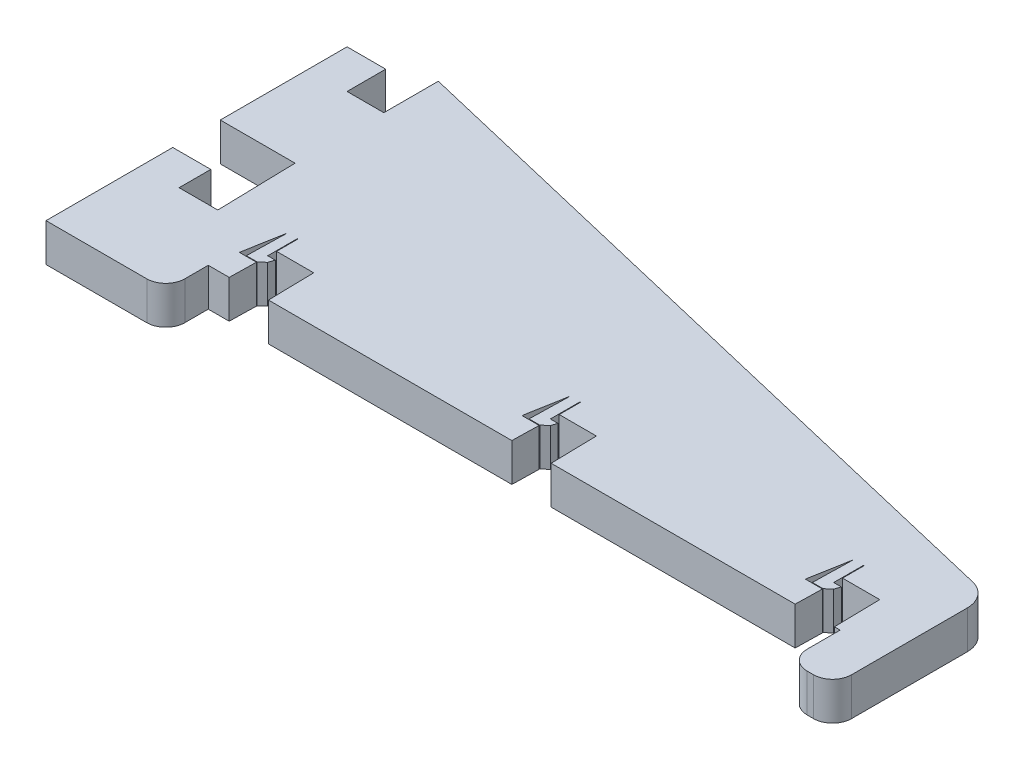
ISO-10303-21;
HEADER;
FILE_DESCRIPTION(('STEP AP214'),'2;1');
FILE_NAME('part.step','',(''),(''),'','','');
FILE_SCHEMA(('AUTOMOTIVE_DESIGN { 1 0 10303 214 1 1 1 1 }'));
ENDSEC;
DATA;
#1=APPLICATION_CONTEXT('core data for automotive mechanical design processes');
#2=APPLICATION_PROTOCOL_DEFINITION('international standard','automotive_design',2000,#1);
#3=PRODUCT_CONTEXT('',#1,'mechanical');
#4=PRODUCT('Part','Part','',(#3));
#5=PRODUCT_RELATED_PRODUCT_CATEGORY('part','',(#4));
#6=PRODUCT_DEFINITION_FORMATION('','',#4);
#7=PRODUCT_DEFINITION_CONTEXT('part definition',#1,'design');
#8=PRODUCT_DEFINITION('design','',#6,#7);
#9=PRODUCT_DEFINITION_SHAPE('','',#8);
#10=(LENGTH_UNIT() NAMED_UNIT(*) SI_UNIT(.MILLI.,.METRE.));
#11=(NAMED_UNIT(*) PLANE_ANGLE_UNIT() SI_UNIT($,.RADIAN.));
#12=(NAMED_UNIT(*) SI_UNIT($,.STERADIAN.) SOLID_ANGLE_UNIT());
#13=UNCERTAINTY_MEASURE_WITH_UNIT(LENGTH_MEASURE(1.E-05),#10,'distance_accuracy_value','');
#14=(GEOMETRIC_REPRESENTATION_CONTEXT(3) GLOBAL_UNCERTAINTY_ASSIGNED_CONTEXT((#13)) GLOBAL_UNIT_ASSIGNED_CONTEXT((#10,
#11,#12)) REPRESENTATION_CONTEXT('',''));
#15=CARTESIAN_POINT('',(0.,0.,0.));
#16=DIRECTION('',(0.,0.,1.));
#17=DIRECTION('',(1.,0.,0.));
#18=AXIS2_PLACEMENT_3D('',#15,#16,#17);
#19=CARTESIAN_POINT('',(4.98683127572,3.,13.21));
#20=DIRECTION('',(-0.650095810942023,0.,-0.759852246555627));
#21=DIRECTION('',(-0.759852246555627,0.,0.650095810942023));
#22=AXIS2_PLACEMENT_3D('',#19,#20,#21);
#23=PLANE('',#22);
#24=DIRECTION('',(-0.759852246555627,0.,0.650095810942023));
#25=VECTOR('',#24,1.);
#26=CARTESIAN_POINT('',(4.98683127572,3.,13.21));
#27=LINE('',#26,#25);
#28=CARTESIAN_POINT('',(4.08683127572,3.,13.98));
#29=VERTEX_POINT('',#28);
#30=CARTESIAN_POINT('',(4.98683127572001,3.,13.21));
#31=VERTEX_POINT('',#30);
#32=EDGE_CURVE('E843',#29,#31,#27,.F.);
#33=ORIENTED_EDGE('',*,*,#32,.F.);
#34=DIRECTION('',(0.,1.,0.));
#35=VECTOR('',#34,1.);
#36=CARTESIAN_POINT('',(4.08683127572,3.,13.98));
#37=LINE('',#36,#35);
#38=CARTESIAN_POINT('',(4.08683127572,-3.,13.98));
#39=VERTEX_POINT('',#38);
#40=EDGE_CURVE('E783',#29,#39,#37,.F.);
#41=ORIENTED_EDGE('',*,*,#40,.T.);
#42=DIRECTION('',(-0.759852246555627,0.,0.650095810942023));
#43=VECTOR('',#42,1.);
#44=CARTESIAN_POINT('',(4.98683127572,-3.,13.21));
#45=LINE('',#44,#43);
#46=CARTESIAN_POINT('',(4.98683127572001,-3.,13.21));
#47=VERTEX_POINT('',#46);
#48=EDGE_CURVE('E845',#47,#39,#45,.T.);
#49=ORIENTED_EDGE('',*,*,#48,.F.);
#50=DIRECTION('',(0.,1.,0.));
#51=VECTOR('',#50,1.);
#52=CARTESIAN_POINT('',(4.98683127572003,3.,13.21));
#53=LINE('',#52,#51);
#54=EDGE_CURVE('E837',#47,#31,#53,.T.);
#55=ORIENTED_EDGE('',*,*,#54,.T.);
#56=EDGE_LOOP('',(#33,#41,#49,#55));
#57=FACE_BOUND('',#56,.T.);
#58=ADVANCED_FACE('F17',(#57),#23,.F.);
#59=CARTESIAN_POINT('',(5.28683127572,3.,12.31));
#60=DIRECTION('',(-0.948683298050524,0.,-0.316227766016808));
#61=DIRECTION('',(-0.316227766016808,0.,0.948683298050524));
#62=AXIS2_PLACEMENT_3D('',#59,#60,#61);
#63=PLANE('',#62);
#64=DIRECTION('',(-0.316227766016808,0.,0.948683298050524));
#65=VECTOR('',#64,1.);
#66=CARTESIAN_POINT('',(5.28683127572,3.,12.31));
#67=LINE('',#66,#65);
#68=CARTESIAN_POINT('',(5.28683127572,3.,12.31));
#69=VERTEX_POINT('',#68);
#70=EDGE_CURVE('E835',#31,#69,#67,.F.);
#71=ORIENTED_EDGE('',*,*,#70,.F.);
#72=ORIENTED_EDGE('',*,*,#54,.F.);
#73=DIRECTION('',(-0.316227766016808,0.,0.948683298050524));
#74=VECTOR('',#73,1.);
#75=CARTESIAN_POINT('',(5.28683127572,-3.,12.31));
#76=LINE('',#75,#74);
#77=CARTESIAN_POINT('',(5.28683127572,-3.,12.31));
#78=VERTEX_POINT('',#77);
#79=EDGE_CURVE('E840',#78,#47,#76,.T.);
#80=ORIENTED_EDGE('',*,*,#79,.F.);
#81=DIRECTION('',(0.,1.,0.));
#82=VECTOR('',#81,1.);
#83=CARTESIAN_POINT('',(5.28683127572,3.,12.31));
#84=LINE('',#83,#82);
#85=EDGE_CURVE('E777',#78,#69,#84,.T.);
#86=ORIENTED_EDGE('',*,*,#85,.T.);
#87=EDGE_LOOP('',(#71,#72,#80,#86));
#88=FACE_BOUND('',#87,.T.);
#89=ADVANCED_FACE('F1344',(#88),#63,.F.);
#90=CARTESIAN_POINT('',(49.68683127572,3.,13.21));
#91=DIRECTION('',(-0.650095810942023,0.,-0.759852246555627));
#92=DIRECTION('',(-0.759852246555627,0.,0.650095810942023));
#93=AXIS2_PLACEMENT_3D('',#90,#91,#92);
#94=PLANE('',#93);
#95=DIRECTION('',(-0.759852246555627,0.,0.650095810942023));
#96=VECTOR('',#95,1.);
#97=CARTESIAN_POINT('',(49.68683127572,3.,13.21));
#98=LINE('',#97,#96);
#99=CARTESIAN_POINT('',(48.78683127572,3.,13.98));
#100=VERTEX_POINT('',#99);
#101=CARTESIAN_POINT('',(49.68683127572,3.,13.21));
#102=VERTEX_POINT('',#101);
#103=EDGE_CURVE('E828',#100,#102,#98,.F.);
#104=ORIENTED_EDGE('',*,*,#103,.F.);
#105=DIRECTION('',(0.,1.,0.));
#106=VECTOR('',#105,1.);
#107=CARTESIAN_POINT('',(48.78683127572,3.,13.98));
#108=LINE('',#107,#106);
#109=CARTESIAN_POINT('',(48.78683127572,-3.,13.98));
#110=VERTEX_POINT('',#109);
#111=EDGE_CURVE('E768',#100,#110,#108,.F.);
#112=ORIENTED_EDGE('',*,*,#111,.T.);
#113=DIRECTION('',(-0.759852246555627,0.,0.650095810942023));
#114=VECTOR('',#113,1.);
#115=CARTESIAN_POINT('',(49.68683127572,-3.,13.21));
#116=LINE('',#115,#114);
#117=CARTESIAN_POINT('',(49.68683127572,-3.,13.21));
#118=VERTEX_POINT('',#117);
#119=EDGE_CURVE('E831',#118,#110,#116,.T.);
#120=ORIENTED_EDGE('',*,*,#119,.F.);
#121=DIRECTION('',(0.,1.,0.));
#122=VECTOR('',#121,1.);
#123=CARTESIAN_POINT('',(49.68683127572,3.,13.21));
#124=LINE('',#123,#122);
#125=EDGE_CURVE('E820',#118,#102,#124,.T.);
#126=ORIENTED_EDGE('',*,*,#125,.T.);
#127=EDGE_LOOP('',(#104,#112,#120,#126));
#128=FACE_BOUND('',#127,.T.);
#129=ADVANCED_FACE('F1293',(#128),#94,.F.);
#130=CARTESIAN_POINT('',(49.98683127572,3.,12.31));
#131=DIRECTION('',(-0.948683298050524,0.,-0.316227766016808));
#132=DIRECTION('',(-0.316227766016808,0.,0.948683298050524));
#133=AXIS2_PLACEMENT_3D('',#130,#131,#132);
#134=PLANE('',#133);
#135=DIRECTION('',(-0.316227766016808,0.,0.948683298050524));
#136=VECTOR('',#135,1.);
#137=CARTESIAN_POINT('',(49.98683127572,3.,12.31));
#138=LINE('',#137,#136);
#139=CARTESIAN_POINT('',(49.98683127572,3.,12.31));
#140=VERTEX_POINT('',#139);
#141=EDGE_CURVE('E810',#102,#140,#138,.F.);
#142=ORIENTED_EDGE('',*,*,#141,.F.);
#143=ORIENTED_EDGE('',*,*,#125,.F.);
#144=DIRECTION('',(-0.316227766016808,0.,0.948683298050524));
#145=VECTOR('',#144,1.);
#146=CARTESIAN_POINT('',(49.98683127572,-3.,12.31));
#147=LINE('',#146,#145);
#148=CARTESIAN_POINT('',(49.98683127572,-3.,12.31));
#149=VERTEX_POINT('',#148);
#150=EDGE_CURVE('E824',#149,#118,#147,.T.);
#151=ORIENTED_EDGE('',*,*,#150,.F.);
#152=DIRECTION('',(0.,1.,0.));
#153=VECTOR('',#152,1.);
#154=CARTESIAN_POINT('',(49.98683127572,3.,12.31));
#155=LINE('',#154,#153);
#156=EDGE_CURVE('E761',#149,#140,#155,.T.);
#157=ORIENTED_EDGE('',*,*,#156,.T.);
#158=EDGE_LOOP('',(#142,#143,#151,#157));
#159=FACE_BOUND('',#158,.T.);
#160=ADVANCED_FACE('F1288',(#159),#134,.F.);
#161=CARTESIAN_POINT('',(-39.61316872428,3.,13.21));
#162=DIRECTION('',(-0.650095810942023,0.,-0.759852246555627));
#163=DIRECTION('',(-0.759852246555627,0.,0.650095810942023));
#164=AXIS2_PLACEMENT_3D('',#161,#162,#163);
#165=PLANE('',#164);
#166=DIRECTION('',(-0.759852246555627,0.,0.650095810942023));
#167=VECTOR('',#166,1.);
#168=CARTESIAN_POINT('',(-39.61316872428,3.,13.21));
#169=LINE('',#168,#167);
#170=CARTESIAN_POINT('',(-40.51316872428,3.,13.98));
#171=VERTEX_POINT('',#170);
#172=CARTESIAN_POINT('',(-39.61316872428,3.,13.21));
#173=VERTEX_POINT('',#172);
#174=EDGE_CURVE('E805',#171,#173,#169,.F.);
#175=ORIENTED_EDGE('',*,*,#174,.F.);
#176=DIRECTION('',(0.,1.,0.));
#177=VECTOR('',#176,1.);
#178=CARTESIAN_POINT('',(-40.51316872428,3.,13.98));
#179=LINE('',#178,#177);
#180=CARTESIAN_POINT('',(-40.51316872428,-3.,13.98));
#181=VERTEX_POINT('',#180);
#182=EDGE_CURVE('E649',#171,#181,#179,.F.);
#183=ORIENTED_EDGE('',*,*,#182,.T.);
#184=DIRECTION('',(-0.759852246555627,0.,0.650095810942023));
#185=VECTOR('',#184,1.);
#186=CARTESIAN_POINT('',(-39.61316872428,-3.,13.21));
#187=LINE('',#186,#185);
#188=CARTESIAN_POINT('',(-39.61316872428,-3.,13.21));
#189=VERTEX_POINT('',#188);
#190=EDGE_CURVE('E807',#189,#181,#187,.T.);
#191=ORIENTED_EDGE('',*,*,#190,.F.);
#192=DIRECTION('',(0.,1.,0.));
#193=VECTOR('',#192,1.);
#194=CARTESIAN_POINT('',(-39.61316872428,3.,13.21));
#195=LINE('',#194,#193);
#196=EDGE_CURVE('E799',#189,#173,#195,.T.);
#197=ORIENTED_EDGE('',*,*,#196,.T.);
#198=EDGE_LOOP('',(#175,#183,#191,#197));
#199=FACE_BOUND('',#198,.T.);
#200=ADVANCED_FACE('F1144',(#199),#165,.F.);
#201=CARTESIAN_POINT('',(-39.31316872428,3.,12.31));
#202=DIRECTION('',(-0.948683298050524,0.,-0.316227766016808));
#203=DIRECTION('',(-0.316227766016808,0.,0.948683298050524));
#204=AXIS2_PLACEMENT_3D('',#201,#202,#203);
#205=PLANE('',#204);
#206=DIRECTION('',(-0.316227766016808,0.,0.948683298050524));
#207=VECTOR('',#206,1.);
#208=CARTESIAN_POINT('',(-39.31316872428,3.,12.31));
#209=LINE('',#208,#207);
#210=CARTESIAN_POINT('',(-39.31316872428,3.,12.31));
#211=VERTEX_POINT('',#210);
#212=EDGE_CURVE('E788',#173,#211,#209,.F.);
#213=ORIENTED_EDGE('',*,*,#212,.F.);
#214=ORIENTED_EDGE('',*,*,#196,.F.);
#215=DIRECTION('',(-0.316227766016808,0.,0.948683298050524));
#216=VECTOR('',#215,1.);
#217=CARTESIAN_POINT('',(-39.31316872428,-3.,12.31));
#218=LINE('',#217,#216);
#219=CARTESIAN_POINT('',(-39.31316872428,-3.,12.31));
#220=VERTEX_POINT('',#219);
#221=EDGE_CURVE('E802',#220,#189,#218,.T.);
#222=ORIENTED_EDGE('',*,*,#221,.F.);
#223=DIRECTION('',(0.,1.,0.));
#224=VECTOR('',#223,1.);
#225=CARTESIAN_POINT('',(-39.31316872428,3.,12.31));
#226=LINE('',#225,#224);
#227=EDGE_CURVE('E643',#220,#211,#226,.T.);
#228=ORIENTED_EDGE('',*,*,#227,.T.);
#229=EDGE_LOOP('',(#213,#214,#222,#228));
#230=FACE_BOUND('',#229,.T.);
#231=ADVANCED_FACE('F1141',(#230),#205,.F.);
#232=CARTESIAN_POINT('',(4.08683127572,3.,13.98));
#233=DIRECTION('',(0.,0.,-1.));
#234=DIRECTION('',(-1.,0.,0.));
#235=AXIS2_PLACEMENT_3D('',#232,#233,#234);
#236=PLANE('',#235);
#237=DIRECTION('',(1.,0.,0.));
#238=VECTOR('',#237,1.);
#239=CARTESIAN_POINT('',(0.,3.,13.98));
#240=LINE('',#239,#238);
#241=CARTESIAN_POINT('',(2.39683127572,3.,13.98));
#242=VERTEX_POINT('',#241);
#243=EDGE_CURVE('E638',#242,#29,#240,.T.);
#244=ORIENTED_EDGE('',*,*,#243,.F.);
#245=DIRECTION('',(0.,1.,0.));
#246=VECTOR('',#245,1.);
#247=CARTESIAN_POINT('',(2.39683127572,3.,13.98));
#248=LINE('',#247,#246);
#249=CARTESIAN_POINT('',(2.39683127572,-3.,13.98));
#250=VERTEX_POINT('',#249);
#251=EDGE_CURVE('E584',#242,#250,#248,.F.);
#252=ORIENTED_EDGE('',*,*,#251,.T.);
#253=DIRECTION('',(-1.,0.,0.));
#254=VECTOR('',#253,1.);
#255=CARTESIAN_POINT('',(4.08683127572,-3.,13.98));
#256=LINE('',#255,#254);
#257=EDGE_CURVE('E786',#39,#250,#256,.T.);
#258=ORIENTED_EDGE('',*,*,#257,.F.);
#259=ORIENTED_EDGE('',*,*,#40,.F.);
#260=EDGE_LOOP('',(#244,#252,#258,#259));
#261=FACE_BOUND('',#260,.T.);
#262=ADVANCED_FACE('F1348',(#261),#236,.F.);
#263=CARTESIAN_POINT('',(4.08683127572,3.,12.31));
#264=DIRECTION('',(0.,0.,1.));
#265=DIRECTION('',(1.,0.,0.));
#266=AXIS2_PLACEMENT_3D('',#263,#264,#265);
#267=PLANE('',#266);
#268=DIRECTION('',(1.,0.,0.));
#269=VECTOR('',#268,1.);
#270=CARTESIAN_POINT('',(0.,3.,12.31));
#271=LINE('',#270,#269);
#272=CARTESIAN_POINT('',(4.08683127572,3.,12.31));
#273=VERTEX_POINT('',#272);
#274=EDGE_CURVE('E636',#69,#273,#271,.F.);
#275=ORIENTED_EDGE('',*,*,#274,.F.);
#276=ORIENTED_EDGE('',*,*,#85,.F.);
#277=DIRECTION('',(1.,0.,0.));
#278=VECTOR('',#277,1.);
#279=CARTESIAN_POINT('',(4.08683127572,-3.,12.31));
#280=LINE('',#279,#278);
#281=CARTESIAN_POINT('',(4.08683127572,-3.,12.31));
#282=VERTEX_POINT('',#281);
#283=EDGE_CURVE('E780',#282,#78,#280,.T.);
#284=ORIENTED_EDGE('',*,*,#283,.F.);
#285=DIRECTION('',(0.,1.,0.));
#286=VECTOR('',#285,1.);
#287=CARTESIAN_POINT('',(4.08683127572,3.,12.31));
#288=LINE('',#287,#286);
#289=EDGE_CURVE('E581',#282,#273,#288,.T.);
#290=ORIENTED_EDGE('',*,*,#289,.T.);
#291=EDGE_LOOP('',(#275,#276,#284,#290));
#292=FACE_BOUND('',#291,.T.);
#293=ADVANCED_FACE('F1339',(#292),#267,.F.);
#294=CARTESIAN_POINT('',(4.18683127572,3.,7.62));
#295=DIRECTION('',(0.,0.,-1.));
#296=DIRECTION('',(-1.,0.,0.));
#297=AXIS2_PLACEMENT_3D('',#294,#295,#296);
#298=PLANE('',#297);
#299=DIRECTION('',(1.,0.,0.));
#300=VECTOR('',#299,1.);
#301=CARTESIAN_POINT('',(0.,3.,7.62));
#302=LINE('',#301,#300);
#303=CARTESIAN_POINT('',(4.08683127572,3.,7.62));
#304=VERTEX_POINT('',#303);
#305=CARTESIAN_POINT('',(4.18683127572,3.,7.62));
#306=VERTEX_POINT('',#305);
#307=EDGE_CURVE('E634',#304,#306,#302,.T.);
#308=ORIENTED_EDGE('',*,*,#307,.F.);
#309=DIRECTION('',(0.,1.,0.));
#310=VECTOR('',#309,1.);
#311=CARTESIAN_POINT('',(4.08683127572,3.,7.62));
#312=LINE('',#311,#310);
#313=CARTESIAN_POINT('',(4.08683127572,-3.,7.62));
#314=VERTEX_POINT('',#313);
#315=EDGE_CURVE('E575',#304,#314,#312,.F.);
#316=ORIENTED_EDGE('',*,*,#315,.T.);
#317=DIRECTION('',(-1.,0.,0.));
#318=VECTOR('',#317,1.);
#319=CARTESIAN_POINT('',(4.18683127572,-3.,7.62));
#320=LINE('',#319,#318);
#321=CARTESIAN_POINT('',(4.18683127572,-3.,7.62));
#322=VERTEX_POINT('',#321);
#323=EDGE_CURVE('E775',#322,#314,#320,.T.);
#324=ORIENTED_EDGE('',*,*,#323,.F.);
#325=DIRECTION('',(0.,1.,0.));
#326=VECTOR('',#325,1.);
#327=CARTESIAN_POINT('',(4.18683127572,3.,7.62));
#328=LINE('',#327,#326);
#329=EDGE_CURVE('E572',#322,#306,#328,.T.);
#330=ORIENTED_EDGE('',*,*,#329,.T.);
#331=EDGE_LOOP('',(#308,#316,#324,#330));
#332=FACE_BOUND('',#331,.T.);
#333=ADVANCED_FACE('F1332',(#332),#298,.F.);
#334=CARTESIAN_POINT('',(48.78683127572,3.,13.98));
#335=DIRECTION('',(0.,0.,-1.));
#336=DIRECTION('',(-1.,0.,0.));
#337=AXIS2_PLACEMENT_3D('',#334,#335,#336);
#338=PLANE('',#337);
#339=DIRECTION('',(1.,0.,0.));
#340=VECTOR('',#339,1.);
#341=CARTESIAN_POINT('',(0.,3.,13.98));
#342=LINE('',#341,#340);
#343=CARTESIAN_POINT('',(47.09683127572,3.,13.98));
#344=VERTEX_POINT('',#343);
#345=EDGE_CURVE('E630',#344,#100,#342,.T.);
#346=ORIENTED_EDGE('',*,*,#345,.F.);
#347=DIRECTION('',(0.,1.,0.));
#348=VECTOR('',#347,1.);
#349=CARTESIAN_POINT('',(47.09683127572,3.,13.98));
#350=LINE('',#349,#348);
#351=CARTESIAN_POINT('',(47.09683127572,-3.,13.98));
#352=VERTEX_POINT('',#351);
#353=EDGE_CURVE('E522',#344,#352,#350,.F.);
#354=ORIENTED_EDGE('',*,*,#353,.T.);
#355=DIRECTION('',(-1.,0.,0.));
#356=VECTOR('',#355,1.);
#357=CARTESIAN_POINT('',(48.78683127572,-3.,13.98));
#358=LINE('',#357,#356);
#359=EDGE_CURVE('E772',#110,#352,#358,.T.);
#360=ORIENTED_EDGE('',*,*,#359,.F.);
#361=ORIENTED_EDGE('',*,*,#111,.F.);
#362=EDGE_LOOP('',(#346,#354,#360,#361));
#363=FACE_BOUND('',#362,.T.);
#364=ADVANCED_FACE('F1295',(#363),#338,.F.);
#365=CARTESIAN_POINT('',(48.78683127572,3.,12.31));
#366=DIRECTION('',(0.,0.,1.));
#367=DIRECTION('',(1.,0.,0.));
#368=AXIS2_PLACEMENT_3D('',#365,#366,#367);
#369=PLANE('',#368);
#370=DIRECTION('',(1.,0.,0.));
#371=VECTOR('',#370,1.);
#372=CARTESIAN_POINT('',(0.,3.,12.31));
#373=LINE('',#372,#371);
#374=CARTESIAN_POINT('',(48.78683127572,3.,12.31));
#375=VERTEX_POINT('',#374);
#376=EDGE_CURVE('E627',#140,#375,#373,.F.);
#377=ORIENTED_EDGE('',*,*,#376,.F.);
#378=ORIENTED_EDGE('',*,*,#156,.F.);
#379=DIRECTION('',(1.,0.,0.));
#380=VECTOR('',#379,1.);
#381=CARTESIAN_POINT('',(48.78683127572,-3.,12.31));
#382=LINE('',#381,#380);
#383=CARTESIAN_POINT('',(48.78683127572,-3.,12.31));
#384=VERTEX_POINT('',#383);
#385=EDGE_CURVE('E764',#384,#149,#382,.T.);
#386=ORIENTED_EDGE('',*,*,#385,.F.);
#387=DIRECTION('',(0.,1.,0.));
#388=VECTOR('',#387,1.);
#389=CARTESIAN_POINT('',(48.78683127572,3.,12.31));
#390=LINE('',#389,#388);
#391=EDGE_CURVE('E518',#384,#375,#390,.T.);
#392=ORIENTED_EDGE('',*,*,#391,.T.);
#393=EDGE_LOOP('',(#377,#378,#386,#392));
#394=FACE_BOUND('',#393,.T.);
#395=ADVANCED_FACE('F1284',(#394),#369,.F.);
#396=CARTESIAN_POINT('',(48.88683127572,3.,7.62));
#397=DIRECTION('',(0.,0.,-1.));
#398=DIRECTION('',(-1.,0.,0.));
#399=AXIS2_PLACEMENT_3D('',#396,#397,#398);
#400=PLANE('',#399);
#401=DIRECTION('',(1.,0.,0.));
#402=VECTOR('',#401,1.);
#403=CARTESIAN_POINT('',(0.,3.,7.62));
#404=LINE('',#403,#402);
#405=CARTESIAN_POINT('',(48.78683127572,3.,7.62));
#406=VERTEX_POINT('',#405);
#407=CARTESIAN_POINT('',(48.88683127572,3.,7.62));
#408=VERTEX_POINT('',#407);
#409=EDGE_CURVE('E625',#406,#408,#404,.T.);
#410=ORIENTED_EDGE('',*,*,#409,.F.);
#411=DIRECTION('',(0.,1.,0.));
#412=VECTOR('',#411,1.);
#413=CARTESIAN_POINT('',(48.78683127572,3.,7.62));
#414=LINE('',#413,#412);
#415=CARTESIAN_POINT('',(48.78683127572,-3.,7.62));
#416=VERTEX_POINT('',#415);
#417=EDGE_CURVE('E511',#406,#416,#414,.F.);
#418=ORIENTED_EDGE('',*,*,#417,.T.);
#419=DIRECTION('',(-1.,0.,0.));
#420=VECTOR('',#419,1.);
#421=CARTESIAN_POINT('',(48.88683127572,-3.,7.62));
#422=LINE('',#421,#420);
#423=CARTESIAN_POINT('',(48.88683127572,-3.,7.62));
#424=VERTEX_POINT('',#423);
#425=EDGE_CURVE('E753',#424,#416,#422,.T.);
#426=ORIENTED_EDGE('',*,*,#425,.F.);
#427=DIRECTION('',(0.,1.,0.));
#428=VECTOR('',#427,1.);
#429=CARTESIAN_POINT('',(48.88683127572,3.,7.62));
#430=LINE('',#429,#428);
#431=EDGE_CURVE('E508',#424,#408,#430,.T.);
#432=ORIENTED_EDGE('',*,*,#431,.T.);
#433=EDGE_LOOP('',(#410,#418,#426,#432));
#434=FACE_BOUND('',#433,.T.);
#435=ADVANCED_FACE('F1275',(#434),#400,.F.);
#436=CARTESIAN_POINT('',(-43.9,-3.,18.3));
#437=DIRECTION('',(0.,0.,1.));
#438=DIRECTION('',(1.,0.,0.));
#439=AXIS2_PLACEMENT_3D('',#436,#437,#438);
#440=PLANE('',#439);
#441=DIRECTION('',(1.,0.,0.));
#442=VECTOR('',#441,1.);
#443=CARTESIAN_POINT('',(0.,3.,18.3));
#444=LINE('',#443,#442);
#445=CARTESIAN_POINT('',(54.9,3.,18.3));
#446=VERTEX_POINT('',#445);
#447=CARTESIAN_POINT('',(55.8,3.,18.3));
#448=VERTEX_POINT('',#447);
#449=EDGE_CURVE('E464',#446,#448,#444,.T.);
#450=ORIENTED_EDGE('',*,*,#449,.F.);
#451=DIRECTION('',(0.,1.,0.));
#452=VECTOR('',#451,1.);
#453=CARTESIAN_POINT('',(54.9,3.,18.3));
#454=LINE('',#453,#452);
#455=CARTESIAN_POINT('',(54.9,-3.,18.3));
#456=VERTEX_POINT('',#455);
#457=EDGE_CURVE('E470',#446,#456,#454,.F.);
#458=ORIENTED_EDGE('',*,*,#457,.T.);
#459=DIRECTION('',(1.,0.,0.));
#460=VECTOR('',#459,1.);
#461=CARTESIAN_POINT('',(-43.9,-3.,18.3));
#462=LINE('',#461,#460);
#463=CARTESIAN_POINT('',(55.8,-3.,18.3));
#464=VERTEX_POINT('',#463);
#465=EDGE_CURVE('E747',#456,#464,#462,.T.);
#466=ORIENTED_EDGE('',*,*,#465,.T.);
#467=DIRECTION('',(0.,1.,0.));
#468=VECTOR('',#467,1.);
#469=CARTESIAN_POINT('',(55.8,-3.,18.3));
#470=LINE('',#469,#468);
#471=EDGE_CURVE('E469',#448,#464,#470,.F.);
#472=ORIENTED_EDGE('',*,*,#471,.F.);
#473=EDGE_LOOP('',(#450,#458,#466,#472));
#474=FACE_BOUND('',#473,.T.);
#475=ADVANCED_FACE('F1262',(#474),#440,.T.);
#476=CARTESIAN_POINT('',(58.8,-3.,26.5));
#477=DIRECTION('',(0.,0.,1.));
#478=DIRECTION('',(1.,0.,0.));
#479=AXIS2_PLACEMENT_3D('',#476,#477,#478);
#480=PLANE('',#479);
#481=DIRECTION('',(0.,1.,0.));
#482=VECTOR('',#481,1.);
#483=CARTESIAN_POINT('',(58.8,-3.,26.5));
#484=LINE('',#483,#482);
#485=CARTESIAN_POINT('',(58.8,-3.,26.5));
#486=VERTEX_POINT('',#485);
#487=CARTESIAN_POINT('',(58.8,3.,26.5));
#488=VERTEX_POINT('',#487);
#489=EDGE_CURVE('E448',#486,#488,#484,.T.);
#490=ORIENTED_EDGE('',*,*,#489,.F.);
#491=DIRECTION('',(1.,0.,0.));
#492=VECTOR('',#491,1.);
#493=CARTESIAN_POINT('',(58.8,-3.,26.5));
#494=LINE('',#493,#492);
#495=CARTESIAN_POINT('',(59.8,-3.,26.5));
#496=VERTEX_POINT('',#495);
#497=EDGE_CURVE('E654',#486,#496,#494,.T.);
#498=ORIENTED_EDGE('',*,*,#497,.T.);
#499=DIRECTION('',(0.,1.,0.));
#500=VECTOR('',#499,1.);
#501=CARTESIAN_POINT('',(59.8,-3.,26.5));
#502=LINE('',#501,#500);
#503=CARTESIAN_POINT('',(59.8,3.,26.5));
#504=VERTEX_POINT('',#503);
#505=EDGE_CURVE('E484',#504,#496,#502,.F.);
#506=ORIENTED_EDGE('',*,*,#505,.F.);
#507=DIRECTION('',(1.,0.,0.));
#508=VECTOR('',#507,1.);
#509=CARTESIAN_POINT('',(0.,3.,26.5));
#510=LINE('',#509,#508);
#511=EDGE_CURVE('E622',#488,#504,#510,.T.);
#512=ORIENTED_EDGE('',*,*,#511,.F.);
#513=EDGE_LOOP('',(#490,#498,#506,#512));
#514=FACE_BOUND('',#513,.T.);
#515=ADVANCED_FACE('F1257',(#514),#480,.T.);
#516=CARTESIAN_POINT('',(-40.51316872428,3.,13.98));
#517=DIRECTION('',(0.,0.,-1.));
#518=DIRECTION('',(-1.,0.,0.));
#519=AXIS2_PLACEMENT_3D('',#516,#517,#518);
#520=PLANE('',#519);
#521=DIRECTION('',(1.,0.,0.));
#522=VECTOR('',#521,1.);
#523=CARTESIAN_POINT('',(0.,3.,13.98));
#524=LINE('',#523,#522);
#525=CARTESIAN_POINT('',(-42.20316872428,3.,13.98));
#526=VERTEX_POINT('',#525);
#527=EDGE_CURVE('E619',#526,#171,#524,.T.);
#528=ORIENTED_EDGE('',*,*,#527,.F.);
#529=DIRECTION('',(0.,1.,0.));
#530=VECTOR('',#529,1.);
#531=CARTESIAN_POINT('',(-42.20316872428,3.,13.98));
#532=LINE('',#531,#530);
#533=CARTESIAN_POINT('',(-42.20316872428,-3.,13.98));
#534=VERTEX_POINT('',#533);
#535=EDGE_CURVE('E1000',#526,#534,#532,.F.);
#536=ORIENTED_EDGE('',*,*,#535,.T.);
#537=DIRECTION('',(-1.,0.,0.));
#538=VECTOR('',#537,1.);
#539=CARTESIAN_POINT('',(-40.51316872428,-3.,13.98));
#540=LINE('',#539,#538);
#541=EDGE_CURVE('E652',#181,#534,#540,.T.);
#542=ORIENTED_EDGE('',*,*,#541,.F.);
#543=ORIENTED_EDGE('',*,*,#182,.F.);
#544=EDGE_LOOP('',(#528,#536,#542,#543));
#545=FACE_BOUND('',#544,.T.);
#546=ADVANCED_FACE('F1150',(#545),#520,.F.);
#547=CARTESIAN_POINT('',(-40.51316872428,3.,12.31));
#548=DIRECTION('',(0.,0.,1.));
#549=DIRECTION('',(1.,0.,0.));
#550=AXIS2_PLACEMENT_3D('',#547,#548,#549);
#551=PLANE('',#550);
#552=DIRECTION('',(1.,0.,0.));
#553=VECTOR('',#552,1.);
#554=CARTESIAN_POINT('',(0.,3.,12.31));
#555=LINE('',#554,#553);
#556=CARTESIAN_POINT('',(-40.51316872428,3.,12.31));
#557=VERTEX_POINT('',#556);
#558=EDGE_CURVE('E617',#211,#557,#555,.F.);
#559=ORIENTED_EDGE('',*,*,#558,.F.);
#560=ORIENTED_EDGE('',*,*,#227,.F.);
#561=DIRECTION('',(1.,0.,0.));
#562=VECTOR('',#561,1.);
#563=CARTESIAN_POINT('',(-40.51316872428,-3.,12.31));
#564=LINE('',#563,#562);
#565=CARTESIAN_POINT('',(-40.51316872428,-3.,12.31));
#566=VERTEX_POINT('',#565);
#567=EDGE_CURVE('E646',#566,#220,#564,.T.);
#568=ORIENTED_EDGE('',*,*,#567,.F.);
#569=DIRECTION('',(0.,1.,0.));
#570=VECTOR('',#569,1.);
#571=CARTESIAN_POINT('',(-40.51316872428,3.,12.31));
#572=LINE('',#571,#570);
#573=EDGE_CURVE('E1003',#566,#557,#572,.T.);
#574=ORIENTED_EDGE('',*,*,#573,.T.);
#575=EDGE_LOOP('',(#559,#560,#568,#574));
#576=FACE_BOUND('',#575,.T.);
#577=ADVANCED_FACE('F1138',(#576),#551,.F.);
#578=CARTESIAN_POINT('',(-40.41316872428,3.,7.62));
#579=DIRECTION('',(0.,0.,-1.));
#580=DIRECTION('',(-1.,0.,0.));
#581=AXIS2_PLACEMENT_3D('',#578,#579,#580);
#582=PLANE('',#581);
#583=DIRECTION('',(1.,0.,0.));
#584=VECTOR('',#583,1.);
#585=CARTESIAN_POINT('',(0.,3.,7.62));
#586=LINE('',#585,#584);
#587=CARTESIAN_POINT('',(-40.51316872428,3.,7.62));
#588=VERTEX_POINT('',#587);
#589=CARTESIAN_POINT('',(-40.41316872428,3.,7.62));
#590=VERTEX_POINT('',#589);
#591=EDGE_CURVE('E615',#588,#590,#586,.T.);
#592=ORIENTED_EDGE('',*,*,#591,.F.);
#593=DIRECTION('',(0.,1.,0.));
#594=VECTOR('',#593,1.);
#595=CARTESIAN_POINT('',(-40.51316872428,3.,7.62));
#596=LINE('',#595,#594);
#597=CARTESIAN_POINT('',(-40.51316872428,-3.,7.62));
#598=VERTEX_POINT('',#597);
#599=EDGE_CURVE('E1009',#588,#598,#596,.F.);
#600=ORIENTED_EDGE('',*,*,#599,.T.);
#601=DIRECTION('',(-1.,0.,0.));
#602=VECTOR('',#601,1.);
#603=CARTESIAN_POINT('',(-40.41316872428,-3.,7.62));
#604=LINE('',#603,#602);
#605=CARTESIAN_POINT('',(-40.41316872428,-3.,7.62));
#606=VERTEX_POINT('',#605);
#607=EDGE_CURVE('E641',#606,#598,#604,.T.);
#608=ORIENTED_EDGE('',*,*,#607,.F.);
#609=DIRECTION('',(0.,1.,0.));
#610=VECTOR('',#609,1.);
#611=CARTESIAN_POINT('',(-40.41316872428,3.,7.62));
#612=LINE('',#611,#610);
#613=EDGE_CURVE('E1012',#606,#590,#612,.T.);
#614=ORIENTED_EDGE('',*,*,#613,.T.);
#615=EDGE_LOOP('',(#592,#600,#608,#614));
#616=FACE_BOUND('',#615,.T.);
#617=ADVANCED_FACE('F1129',(#616),#582,.F.);
#618=CARTESIAN_POINT('',(0.,3.,0.));
#619=DIRECTION('',(0.,1.,0.));
#620=DIRECTION('',(0.,0.,1.));
#621=AXIS2_PLACEMENT_3D('',#618,#619,#620);
#622=PLANE('',#621);
#623=DIRECTION('',(-1.,0.,0.));
#624=VECTOR('',#623,1.);
#625=CARTESIAN_POINT('',(-34.55,3.,11.01));
#626=LINE('',#625,#624);
#627=CARTESIAN_POINT('',(-40.41316872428,3.,11.01));
#628=VERTEX_POINT('',#627);
#629=CARTESIAN_POINT('',(-34.55,3.,11.01));
#630=VERTEX_POINT('',#629);
#631=EDGE_CURVE('E1018',#628,#630,#626,.F.);
#632=ORIENTED_EDGE('',*,*,#631,.T.);
#633=DIRECTION('',(-0.0205717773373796,0.,-0.999788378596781));
#634=VECTOR('',#633,1.);
#635=CARTESIAN_POINT('',(-34.4,3.,18.3));
#636=LINE('',#635,#634);
#637=CARTESIAN_POINT('',(-34.4,3.,18.3));
#638=VERTEX_POINT('',#637);
#639=EDGE_CURVE('E612',#630,#638,#636,.F.);
#640=ORIENTED_EDGE('',*,*,#639,.T.);
#641=DIRECTION('',(1.,0.,0.));
#642=VECTOR('',#641,1.);
#643=CARTESIAN_POINT('',(-43.9,3.,18.3));
#644=LINE('',#643,#642);
#645=CARTESIAN_POINT('',(3.99999999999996,3.,18.3));
#646=VERTEX_POINT('',#645);
#647=EDGE_CURVE('E610',#646,#638,#644,.F.);
#648=ORIENTED_EDGE('',*,*,#647,.F.);
#649=DIRECTION('',(-0.0205717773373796,0.,0.999788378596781));
#650=VECTOR('',#649,1.);
#651=CARTESIAN_POINT('',(4.08683127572,3.,14.08));
#652=LINE('',#651,#650);
#653=CARTESIAN_POINT('',(4.08683127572,3.,14.08));
#654=VERTEX_POINT('',#653);
#655=EDGE_CURVE('E603',#646,#654,#652,.F.);
#656=ORIENTED_EDGE('',*,*,#655,.T.);
#657=DIRECTION('',(1.,0.,0.));
#658=VECTOR('',#657,1.);
#659=CARTESIAN_POINT('',(1.38683127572,3.,14.08));
#660=LINE('',#659,#658);
#661=CARTESIAN_POINT('',(1.38683127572,3.,14.08));
#662=VERTEX_POINT('',#661);
#663=EDGE_CURVE('E598',#654,#662,#660,.F.);
#664=ORIENTED_EDGE('',*,*,#663,.T.);
#665=DIRECTION('',(-0.175263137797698,0.,0.984521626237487));
#666=VECTOR('',#665,1.);
#667=CARTESIAN_POINT('',(2.53683127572,3.,7.62));
#668=LINE('',#667,#666);
#669=CARTESIAN_POINT('',(2.53683127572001,3.,7.61999999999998));
#670=VERTEX_POINT('',#669);
#671=EDGE_CURVE('E593',#662,#670,#668,.F.);
#672=ORIENTED_EDGE('',*,*,#671,.T.);
#673=DIRECTION('',(0.0220072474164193,0.,-0.99975781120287));
#674=VECTOR('',#673,1.);
#675=CARTESIAN_POINT('',(2.39683127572,3.,13.98));
#676=LINE('',#675,#674);
#677=EDGE_CURVE('E587',#670,#242,#676,.F.);
#678=ORIENTED_EDGE('',*,*,#677,.T.);
#679=ORIENTED_EDGE('',*,*,#243,.T.);
#680=ORIENTED_EDGE('',*,*,#32,.T.);
#681=ORIENTED_EDGE('',*,*,#70,.T.);
#682=ORIENTED_EDGE('',*,*,#274,.T.);
#683=DIRECTION('',(0.,0.,1.));
#684=VECTOR('',#683,1.);
#685=CARTESIAN_POINT('',(4.08683127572,3.,7.62));
#686=LINE('',#685,#684);
#687=EDGE_CURVE('E578',#273,#304,#686,.F.);
#688=ORIENTED_EDGE('',*,*,#687,.T.);
#689=ORIENTED_EDGE('',*,*,#307,.T.);
#690=DIRECTION('',(0.,0.,-1.));
#691=VECTOR('',#690,1.);
#692=CARTESIAN_POINT('',(4.18683127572,3.,11.01));
#693=LINE('',#692,#691);
#694=CARTESIAN_POINT('',(4.18683127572,3.,11.01));
#695=VERTEX_POINT('',#694);
#696=EDGE_CURVE('E570',#306,#695,#693,.F.);
#697=ORIENTED_EDGE('',*,*,#696,.T.);
#698=DIRECTION('',(-1.,0.,0.));
#699=VECTOR('',#698,1.);
#700=CARTESIAN_POINT('',(10.05,3.,11.01));
#701=LINE('',#700,#699);
#702=CARTESIAN_POINT('',(10.05,3.,11.01));
#703=VERTEX_POINT('',#702);
#704=EDGE_CURVE('E565',#695,#703,#701,.F.);
#705=ORIENTED_EDGE('',*,*,#704,.T.);
#706=DIRECTION('',(-0.0205717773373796,0.,-0.999788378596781));
#707=VECTOR('',#706,1.);
#708=CARTESIAN_POINT('',(10.2,3.,18.3));
#709=LINE('',#708,#707);
#710=CARTESIAN_POINT('',(10.2,3.,18.3));
#711=VERTEX_POINT('',#710);
#712=EDGE_CURVE('E559',#703,#711,#709,.F.);
#713=ORIENTED_EDGE('',*,*,#712,.T.);
#714=DIRECTION('',(1.,0.,0.));
#715=VECTOR('',#714,1.);
#716=CARTESIAN_POINT('',(-43.9,3.,18.3));
#717=LINE('',#716,#715);
#718=CARTESIAN_POINT('',(48.7,3.,18.3));
#719=VERTEX_POINT('',#718);
#720=EDGE_CURVE('E556',#719,#711,#717,.F.);
#721=ORIENTED_EDGE('',*,*,#720,.F.);
#722=DIRECTION('',(-0.0205717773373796,0.,0.999788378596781));
#723=VECTOR('',#722,1.);
#724=CARTESIAN_POINT('',(48.78683127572,3.,14.08));
#725=LINE('',#724,#723);
#726=CARTESIAN_POINT('',(48.78683127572,3.,14.08));
#727=VERTEX_POINT('',#726);
#728=EDGE_CURVE('E547',#719,#727,#725,.F.);
#729=ORIENTED_EDGE('',*,*,#728,.T.);
#730=DIRECTION('',(1.,0.,0.));
#731=VECTOR('',#730,1.);
#732=CARTESIAN_POINT('',(46.08683127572,3.,14.08));
#733=LINE('',#732,#731);
#734=CARTESIAN_POINT('',(46.08683127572,3.,14.08));
#735=VERTEX_POINT('',#734);
#736=EDGE_CURVE('E540',#727,#735,#733,.F.);
#737=ORIENTED_EDGE('',*,*,#736,.T.);
#738=DIRECTION('',(-0.175263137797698,0.,0.984521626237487));
#739=VECTOR('',#738,1.);
#740=CARTESIAN_POINT('',(47.23683127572,3.,7.62));
#741=LINE('',#740,#739);
#742=CARTESIAN_POINT('',(47.23683127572,3.,7.61999999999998));
#743=VERTEX_POINT('',#742);
#744=EDGE_CURVE('E533',#735,#743,#741,.F.);
#745=ORIENTED_EDGE('',*,*,#744,.T.);
#746=DIRECTION('',(0.0220072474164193,0.,-0.99975781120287));
#747=VECTOR('',#746,1.);
#748=CARTESIAN_POINT('',(47.09683127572,3.,13.98));
#749=LINE('',#748,#747);
#750=EDGE_CURVE('E526',#743,#344,#749,.F.);
#751=ORIENTED_EDGE('',*,*,#750,.T.);
#752=ORIENTED_EDGE('',*,*,#345,.T.);
#753=ORIENTED_EDGE('',*,*,#103,.T.);
#754=ORIENTED_EDGE('',*,*,#141,.T.);
#755=ORIENTED_EDGE('',*,*,#376,.T.);
#756=DIRECTION('',(0.,0.,1.));
#757=VECTOR('',#756,1.);
#758=CARTESIAN_POINT('',(48.78683127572,3.,7.62));
#759=LINE('',#758,#757);
#760=EDGE_CURVE('E514',#375,#406,#759,.F.);
#761=ORIENTED_EDGE('',*,*,#760,.T.);
#762=ORIENTED_EDGE('',*,*,#409,.T.);
#763=DIRECTION('',(0.,0.,-1.));
#764=VECTOR('',#763,1.);
#765=CARTESIAN_POINT('',(48.88683127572,3.,11.01));
#766=LINE('',#765,#764);
#767=CARTESIAN_POINT('',(48.88683127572,3.,11.01));
#768=VERTEX_POINT('',#767);
#769=EDGE_CURVE('E506',#408,#768,#766,.F.);
#770=ORIENTED_EDGE('',*,*,#769,.T.);
#771=DIRECTION('',(-1.,0.,0.));
#772=VECTOR('',#771,1.);
#773=CARTESIAN_POINT('',(54.75,3.,11.01));
#774=LINE('',#773,#772);
#775=CARTESIAN_POINT('',(54.75,3.,11.01));
#776=VERTEX_POINT('',#775);
#777=EDGE_CURVE('E499',#768,#776,#774,.F.);
#778=ORIENTED_EDGE('',*,*,#777,.T.);
#779=DIRECTION('',(-0.0205717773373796,0.,-0.999788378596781));
#780=VECTOR('',#779,1.);
#781=CARTESIAN_POINT('',(54.9,3.,18.3));
#782=LINE('',#781,#780);
#783=EDGE_CURVE('E498',#776,#446,#782,.F.);
#784=ORIENTED_EDGE('',*,*,#783,.T.);
#785=ORIENTED_EDGE('',*,*,#449,.T.);
#786=DIRECTION('',(0.,0.,1.));
#787=VECTOR('',#786,1.);
#788=CARTESIAN_POINT('',(55.8,3.,18.3));
#789=LINE('',#788,#787);
#790=CARTESIAN_POINT('',(55.8,3.,23.5));
#791=VERTEX_POINT('',#790);
#792=EDGE_CURVE('E460',#791,#448,#789,.F.);
#793=ORIENTED_EDGE('',*,*,#792,.F.);
#794=CARTESIAN_POINT('',(58.8,3.,23.5));
#795=DIRECTION('',(0.,1.,0.));
#796=DIRECTION('',(0.,0.,1.));
#797=AXIS2_PLACEMENT_3D('',#794,#795,#796);
#798=CIRCLE('',#797,3.);
#799=EDGE_CURVE('E20',#488,#791,#798,.F.);
#800=ORIENTED_EDGE('',*,*,#799,.F.);
#801=ORIENTED_EDGE('',*,*,#511,.T.);
#802=CARTESIAN_POINT('',(59.8,3.,23.5));
#803=DIRECTION('',(0.,1.,0.));
#804=DIRECTION('',(0.,0.,1.));
#805=AXIS2_PLACEMENT_3D('',#802,#803,#804);
#806=CIRCLE('',#805,3.);
#807=CARTESIAN_POINT('',(62.8,3.,23.5));
#808=VERTEX_POINT('',#807);
#809=EDGE_CURVE('E477',#808,#504,#806,.F.);
#810=ORIENTED_EDGE('',*,*,#809,.F.);
#811=DIRECTION('',(0.,0.,-1.));
#812=VECTOR('',#811,1.);
#813=CARTESIAN_POINT('',(62.8,3.,23.5));
#814=LINE('',#813,#812);
#815=CARTESIAN_POINT('',(62.8,3.,5.240400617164));
#816=VERTEX_POINT('',#815);
#817=EDGE_CURVE('E742',#816,#808,#814,.F.);
#818=ORIENTED_EDGE('',*,*,#817,.F.);
#819=CARTESIAN_POINT('',(58.7,3.,5.240400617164));
#820=DIRECTION('',(0.,1.,0.));
#821=DIRECTION('',(0.,0.,1.));
#822=AXIS2_PLACEMENT_3D('',#819,#820,#821);
#823=CIRCLE('',#822,4.1);
#824=CARTESIAN_POINT('',(59.6472724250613,3.,1.25133118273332));
#825=VERTEX_POINT('',#824);
#826=EDGE_CURVE('E868',#825,#816,#823,.F.);
#827=ORIENTED_EDGE('',*,*,#826,.F.);
#828=DIRECTION('',(-0.972943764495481,0.,-0.231042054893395));
#829=VECTOR('',#828,1.);
#830=CARTESIAN_POINT('',(59.64727242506,3.,1.251331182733));
#831=LINE('',#830,#829);
#832=CARTESIAN_POINT('',(-50.9,3.,-25.));
#833=VERTEX_POINT('',#832);
#834=EDGE_CURVE('E737',#833,#825,#831,.F.);
#835=ORIENTED_EDGE('',*,*,#834,.F.);
#836=DIRECTION('',(0.,0.,1.));
#837=VECTOR('',#836,1.);
#838=CARTESIAN_POINT('',(-50.9,3.,-25.));
#839=LINE('',#838,#837);
#840=CARTESIAN_POINT('',(-50.9,3.,-16.4));
#841=VERTEX_POINT('',#840);
#842=EDGE_CURVE('E732',#841,#833,#839,.F.);
#843=ORIENTED_EDGE('',*,*,#842,.F.);
#844=DIRECTION('',(-1.,0.,0.));
#845=VECTOR('',#844,1.);
#846=CARTESIAN_POINT('',(-50.9,3.,-16.4));
#847=LINE('',#846,#845);
#848=CARTESIAN_POINT('',(-56.7,3.,-16.4));
#849=VERTEX_POINT('',#848);
#850=EDGE_CURVE('E727',#849,#841,#847,.F.);
#851=ORIENTED_EDGE('',*,*,#850,.F.);
#852=DIRECTION('',(0.,0.,-1.));
#853=VECTOR('',#852,1.);
#854=CARTESIAN_POINT('',(-56.7,3.,-16.4));
#855=LINE('',#854,#853);
#856=CARTESIAN_POINT('',(-56.7,3.,-22.5));
#857=VERTEX_POINT('',#856);
#858=EDGE_CURVE('E722',#857,#849,#855,.F.);
#859=ORIENTED_EDGE('',*,*,#858,.F.);
#860=DIRECTION('',(-1.,0.,0.));
#861=VECTOR('',#860,1.);
#862=CARTESIAN_POINT('',(-56.7,3.,-22.5));
#863=LINE('',#862,#861);
#864=CARTESIAN_POINT('',(-62.8,3.,-22.5));
#865=VERTEX_POINT('',#864);
#866=EDGE_CURVE('E717',#865,#857,#863,.F.);
#867=ORIENTED_EDGE('',*,*,#866,.F.);
#868=DIRECTION('',(0.,0.,1.));
#869=VECTOR('',#868,1.);
#870=CARTESIAN_POINT('',(-62.8,3.,-22.5));
#871=LINE('',#870,#869);
#872=CARTESIAN_POINT('',(-62.8,3.,-2.5));
#873=VERTEX_POINT('',#872);
#874=EDGE_CURVE('E712',#873,#865,#871,.F.);
#875=ORIENTED_EDGE('',*,*,#874,.F.);
#876=DIRECTION('',(1.,0.,0.));
#877=VECTOR('',#876,1.);
#878=CARTESIAN_POINT('',(-62.8,3.,-2.5));
#879=LINE('',#878,#877);
#880=CARTESIAN_POINT('',(-51.00549341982,3.,-2.5));
#881=VERTEX_POINT('',#880);
#882=EDGE_CURVE('E707',#881,#873,#879,.F.);
#883=ORIENTED_EDGE('',*,*,#882,.F.);
#884=DIRECTION('',(0.0244321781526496,0.,0.999701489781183));
#885=VECTOR('',#884,1.);
#886=CARTESIAN_POINT('',(-51.00549341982,3.,-2.5));
#887=LINE('',#886,#885);
#888=CARTESIAN_POINT('',(-50.7000000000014,3.,10.));
#889=VERTEX_POINT('',#888);
#890=EDGE_CURVE('E702',#889,#881,#887,.F.);
#891=ORIENTED_EDGE('',*,*,#890,.F.);
#892=DIRECTION('',(-1.,0.,0.));
#893=VECTOR('',#892,1.);
#894=CARTESIAN_POINT('',(-50.7,3.,10.));
#895=LINE('',#894,#893);
#896=CARTESIAN_POINT('',(-56.8,3.,10.));
#897=VERTEX_POINT('',#896);
#898=EDGE_CURVE('E697',#897,#889,#895,.F.);
#899=ORIENTED_EDGE('',*,*,#898,.F.);
#900=DIRECTION('',(0.,0.,-1.));
#901=VECTOR('',#900,1.);
#902=CARTESIAN_POINT('',(-56.8,3.,10.));
#903=LINE('',#902,#901);
#904=CARTESIAN_POINT('',(-56.8,3.,5.));
#905=VERTEX_POINT('',#904);
#906=EDGE_CURVE('E692',#905,#897,#903,.F.);
#907=ORIENTED_EDGE('',*,*,#906,.F.);
#908=DIRECTION('',(-1.,0.,0.));
#909=VECTOR('',#908,1.);
#910=CARTESIAN_POINT('',(-56.8,3.,5.));
#911=LINE('',#910,#909);
#912=CARTESIAN_POINT('',(-62.8,3.,5.));
#913=VERTEX_POINT('',#912);
#914=EDGE_CURVE('E687',#913,#905,#911,.F.);
#915=ORIENTED_EDGE('',*,*,#914,.F.);
#916=DIRECTION('',(0.,0.,1.));
#917=VECTOR('',#916,1.);
#918=CARTESIAN_POINT('',(-62.8,3.,5.));
#919=LINE('',#918,#917);
#920=CARTESIAN_POINT('',(-62.8,3.,25.));
#921=VERTEX_POINT('',#920);
#922=EDGE_CURVE('E682',#921,#913,#919,.F.);
#923=ORIENTED_EDGE('',*,*,#922,.F.);
#924=DIRECTION('',(1.,0.,0.));
#925=VECTOR('',#924,1.);
#926=CARTESIAN_POINT('',(-62.8,3.,25.));
#927=LINE('',#926,#925);
#928=CARTESIAN_POINT('',(-46.9,3.,25.));
#929=VERTEX_POINT('',#928);
#930=EDGE_CURVE('E676',#929,#921,#927,.F.);
#931=ORIENTED_EDGE('',*,*,#930,.F.);
#932=CARTESIAN_POINT('',(-46.9,3.,22.));
#933=DIRECTION('',(0.,1.,0.));
#934=DIRECTION('',(0.,0.,1.));
#935=AXIS2_PLACEMENT_3D('',#932,#933,#934);
#936=CIRCLE('',#935,3.);
#937=CARTESIAN_POINT('',(-43.9,3.,22.));
#938=VERTEX_POINT('',#937);
#939=EDGE_CURVE('E866',#938,#929,#936,.F.);
#940=ORIENTED_EDGE('',*,*,#939,.F.);
#941=DIRECTION('',(0.,0.,-1.));
#942=VECTOR('',#941,1.);
#943=CARTESIAN_POINT('',(-43.9,3.,22.));
#944=LINE('',#943,#942);
#945=CARTESIAN_POINT('',(-43.9,3.,18.3));
#946=VERTEX_POINT('',#945);
#947=EDGE_CURVE('E655',#946,#938,#944,.F.);
#948=ORIENTED_EDGE('',*,*,#947,.F.);
#949=DIRECTION('',(1.,0.,0.));
#950=VECTOR('',#949,1.);
#951=CARTESIAN_POINT('',(-43.9,3.,18.3));
#952=LINE('',#951,#950);
#953=CARTESIAN_POINT('',(-40.6,3.,18.3));
#954=VERTEX_POINT('',#953);
#955=EDGE_CURVE('E661',#954,#946,#952,.F.);
#956=ORIENTED_EDGE('',*,*,#955,.F.);
#957=DIRECTION('',(-0.0205717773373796,0.,0.999788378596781));
#958=VECTOR('',#957,1.);
#959=CARTESIAN_POINT('',(-40.51316872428,3.,14.08));
#960=LINE('',#959,#958);
#961=CARTESIAN_POINT('',(-40.51316872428,3.,14.08));
#962=VERTEX_POINT('',#961);
#963=EDGE_CURVE('E666',#954,#962,#960,.F.);
#964=ORIENTED_EDGE('',*,*,#963,.T.);
#965=DIRECTION('',(1.,0.,0.));
#966=VECTOR('',#965,1.);
#967=CARTESIAN_POINT('',(-43.21316872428,3.,14.08));
#968=LINE('',#967,#966);
#969=CARTESIAN_POINT('',(-43.21316872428,3.,14.08));
#970=VERTEX_POINT('',#969);
#971=EDGE_CURVE('E987',#962,#970,#968,.F.);
#972=ORIENTED_EDGE('',*,*,#971,.T.);
#973=DIRECTION('',(-0.175263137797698,0.,0.984521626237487));
#974=VECTOR('',#973,1.);
#975=CARTESIAN_POINT('',(-42.06316872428,3.,7.62));
#976=LINE('',#975,#974);
#977=CARTESIAN_POINT('',(-42.06316872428,3.,7.61999999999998));
#978=VERTEX_POINT('',#977);
#979=EDGE_CURVE('E992',#970,#978,#976,.F.);
#980=ORIENTED_EDGE('',*,*,#979,.T.);
#981=DIRECTION('',(0.0220072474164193,0.,-0.99975781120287));
#982=VECTOR('',#981,1.);
#983=CARTESIAN_POINT('',(-42.20316872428,3.,13.98));
#984=LINE('',#983,#982);
#985=EDGE_CURVE('E997',#978,#526,#984,.F.);
#986=ORIENTED_EDGE('',*,*,#985,.T.);
#987=ORIENTED_EDGE('',*,*,#527,.T.);
#988=ORIENTED_EDGE('',*,*,#174,.T.);
#989=ORIENTED_EDGE('',*,*,#212,.T.);
#990=ORIENTED_EDGE('',*,*,#558,.T.);
#991=DIRECTION('',(0.,0.,1.));
#992=VECTOR('',#991,1.);
#993=CARTESIAN_POINT('',(-40.51316872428,3.,7.62));
#994=LINE('',#993,#992);
#995=EDGE_CURVE('E1006',#557,#588,#994,.F.);
#996=ORIENTED_EDGE('',*,*,#995,.T.);
#997=ORIENTED_EDGE('',*,*,#591,.T.);
#998=DIRECTION('',(0.,0.,-1.));
#999=VECTOR('',#998,1.);
#1000=CARTESIAN_POINT('',(-40.41316872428,3.,11.01));
#1001=LINE('',#1000,#999);
#1002=EDGE_CURVE('E1015',#590,#628,#1001,.F.);
#1003=ORIENTED_EDGE('',*,*,#1002,.T.);
#1004=EDGE_LOOP('',(#632,#640,#648,#656,#664,#672,#678,#679,#680,#681,#682,#688,#689,#697,#705,
#713,#721,#729,#737,#745,#751,#752,#753,#754,#755,#761,#762,#770,#778,#784,#785,#793,#800,#801,
#810,#818,#827,#835,#843,#851,#859,#867,#875,#883,#891,#899,#907,#915,#923,#931,#940,#948,#956,
#964,#972,#980,#986,#987,#988,#989,#990,#996,#997,#1003));
#1005=FACE_BOUND('',#1004,.T.);
#1006=ADVANCED_FACE('F462',(#1005),#622,.T.);
#1007=CARTESIAN_POINT('',(-34.4,3.,18.3));
#1008=DIRECTION('',(0.999788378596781,0.,-0.0205717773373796));
#1009=DIRECTION('',(-0.0205717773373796,0.,-0.999788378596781));
#1010=AXIS2_PLACEMENT_3D('',#1007,#1008,#1009);
#1011=PLANE('',#1010);
#1012=ORIENTED_EDGE('',*,*,#639,.F.);
#1013=DIRECTION('',(0.,1.,0.));
#1014=VECTOR('',#1013,1.);
#1015=CARTESIAN_POINT('',(-34.55,3.,11.01));
#1016=LINE('',#1015,#1014);
#1017=CARTESIAN_POINT('',(-34.55,-3.,11.01));
#1018=VERTEX_POINT('',#1017);
#1019=EDGE_CURVE('E1020',#630,#1018,#1016,.F.);
#1020=ORIENTED_EDGE('',*,*,#1019,.T.);
#1021=DIRECTION('',(0.020571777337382,0.,0.999788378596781));
#1022=VECTOR('',#1021,1.);
#1023=CARTESIAN_POINT('',(-34.55,-3.,11.01));
#1024=LINE('',#1023,#1022);
#1025=CARTESIAN_POINT('',(-34.4,-3.,18.3));
#1026=VERTEX_POINT('',#1025);
#1027=EDGE_CURVE('E1023',#1018,#1026,#1024,.T.);
#1028=ORIENTED_EDGE('',*,*,#1027,.T.);
#1029=DIRECTION('',(0.,1.,0.));
#1030=VECTOR('',#1029,1.);
#1031=CARTESIAN_POINT('',(-34.4,-3.,18.3));
#1032=LINE('',#1031,#1030);
#1033=EDGE_CURVE('E608',#638,#1026,#1032,.F.);
#1034=ORIENTED_EDGE('',*,*,#1033,.F.);
#1035=EDGE_LOOP('',(#1012,#1020,#1028,#1034));
#1036=FACE_BOUND('',#1035,.T.);
#1037=ADVANCED_FACE('F1368',(#1036),#1011,.F.);
#1038=CARTESIAN_POINT('',(-43.9,-3.,18.3));
#1039=DIRECTION('',(0.,0.,1.));
#1040=DIRECTION('',(1.,0.,0.));
#1041=AXIS2_PLACEMENT_3D('',#1038,#1039,#1040);
#1042=PLANE('',#1041);
#1043=ORIENTED_EDGE('',*,*,#647,.T.);
#1044=ORIENTED_EDGE('',*,*,#1033,.T.);
#1045=DIRECTION('',(1.,0.,0.));
#1046=VECTOR('',#1045,1.);
#1047=CARTESIAN_POINT('',(0.,-3.,18.3));
#1048=LINE('',#1047,#1046);
#1049=CARTESIAN_POINT('',(3.99999999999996,-3.,18.3));
#1050=VERTEX_POINT('',#1049);
#1051=EDGE_CURVE('E1026',#1026,#1050,#1048,.T.);
#1052=ORIENTED_EDGE('',*,*,#1051,.T.);
#1053=DIRECTION('',(0.,1.,0.));
#1054=VECTOR('',#1053,1.);
#1055=CARTESIAN_POINT('',(3.99999999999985,3.,18.3));
#1056=LINE('',#1055,#1054);
#1057=EDGE_CURVE('E605',#1050,#646,#1056,.T.);
#1058=ORIENTED_EDGE('',*,*,#1057,.T.);
#1059=EDGE_LOOP('',(#1043,#1044,#1052,#1058));
#1060=FACE_BOUND('',#1059,.T.);
#1061=ADVANCED_FACE('F1367',(#1060),#1042,.T.);
#1062=CARTESIAN_POINT('',(4.08683127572,3.,14.08));
#1063=DIRECTION('',(-0.999788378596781,0.,-0.0205717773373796));
#1064=DIRECTION('',(-0.0205717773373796,0.,0.999788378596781));
#1065=AXIS2_PLACEMENT_3D('',#1062,#1063,#1064);
#1066=PLANE('',#1065);
#1067=ORIENTED_EDGE('',*,*,#655,.F.);
#1068=ORIENTED_EDGE('',*,*,#1057,.F.);
#1069=DIRECTION('',(0.0205717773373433,0.,-0.999788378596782));
#1070=VECTOR('',#1069,1.);
#1071=CARTESIAN_POINT('',(4.,-3.,18.3));
#1072=LINE('',#1071,#1070);
#1073=CARTESIAN_POINT('',(4.08683127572,-3.,14.08));
#1074=VERTEX_POINT('',#1073);
#1075=EDGE_CURVE('E1029',#1050,#1074,#1072,.T.);
#1076=ORIENTED_EDGE('',*,*,#1075,.T.);
#1077=DIRECTION('',(0.,1.,0.));
#1078=VECTOR('',#1077,1.);
#1079=CARTESIAN_POINT('',(4.08683127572,3.,14.08));
#1080=LINE('',#1079,#1078);
#1081=EDGE_CURVE('E600',#1074,#654,#1080,.T.);
#1082=ORIENTED_EDGE('',*,*,#1081,.T.);
#1083=EDGE_LOOP('',(#1067,#1068,#1076,#1082));
#1084=FACE_BOUND('',#1083,.T.);
#1085=ADVANCED_FACE('F1365',(#1084),#1066,.F.);
#1086=CARTESIAN_POINT('',(1.38683127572,3.,14.08));
#1087=DIRECTION('',(0.,0.,1.));
#1088=DIRECTION('',(1.,0.,0.));
#1089=AXIS2_PLACEMENT_3D('',#1086,#1087,#1088);
#1090=PLANE('',#1089);
#1091=ORIENTED_EDGE('',*,*,#663,.F.);
#1092=ORIENTED_EDGE('',*,*,#1081,.F.);
#1093=DIRECTION('',(1.,0.,0.));
#1094=VECTOR('',#1093,1.);
#1095=CARTESIAN_POINT('',(0.,-3.,14.08));
#1096=LINE('',#1095,#1094);
#1097=CARTESIAN_POINT('',(1.38683127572,-3.,14.08));
#1098=VERTEX_POINT('',#1097);
#1099=EDGE_CURVE('E1032',#1074,#1098,#1096,.F.);
#1100=ORIENTED_EDGE('',*,*,#1099,.T.);
#1101=DIRECTION('',(0.,1.,0.));
#1102=VECTOR('',#1101,1.);
#1103=CARTESIAN_POINT('',(1.38683127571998,3.,14.08));
#1104=LINE('',#1103,#1102);
#1105=EDGE_CURVE('E595',#1098,#662,#1104,.T.);
#1106=ORIENTED_EDGE('',*,*,#1105,.T.);
#1107=EDGE_LOOP('',(#1091,#1092,#1100,#1106));
#1108=FACE_BOUND('',#1107,.T.);
#1109=ADVANCED_FACE('F1362',(#1108),#1090,.F.);
#1110=CARTESIAN_POINT('',(2.53683127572,3.,7.62));
#1111=DIRECTION('',(-0.984521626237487,0.,-0.175263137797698));
#1112=DIRECTION('',(-0.175263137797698,0.,0.984521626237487));
#1113=AXIS2_PLACEMENT_3D('',#1110,#1111,#1112);
#1114=PLANE('',#1113);
#1115=ORIENTED_EDGE('',*,*,#671,.F.);
#1116=ORIENTED_EDGE('',*,*,#1105,.F.);
#1117=DIRECTION('',(0.175263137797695,0.,-0.984521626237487));
#1118=VECTOR('',#1117,1.);
#1119=CARTESIAN_POINT('',(1.38683127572,-3.,14.08));
#1120=LINE('',#1119,#1118);
#1121=CARTESIAN_POINT('',(2.53683127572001,-3.,7.61999999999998));
#1122=VERTEX_POINT('',#1121);
#1123=EDGE_CURVE('E1035',#1098,#1122,#1120,.T.);
#1124=ORIENTED_EDGE('',*,*,#1123,.T.);
#1125=DIRECTION('',(0.,1.,0.));
#1126=VECTOR('',#1125,1.);
#1127=CARTESIAN_POINT('',(2.53683127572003,3.,7.62));
#1128=LINE('',#1127,#1126);
#1129=EDGE_CURVE('E590',#1122,#670,#1128,.T.);
#1130=ORIENTED_EDGE('',*,*,#1129,.T.);
#1131=EDGE_LOOP('',(#1115,#1116,#1124,#1130));
#1132=FACE_BOUND('',#1131,.T.);
#1133=ADVANCED_FACE('F1356',(#1132),#1114,.F.);
#1134=CARTESIAN_POINT('',(2.39683127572,3.,13.98));
#1135=DIRECTION('',(0.99975781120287,0.,0.0220072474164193));
#1136=DIRECTION('',(0.0220072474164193,0.,-0.99975781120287));
#1137=AXIS2_PLACEMENT_3D('',#1134,#1135,#1136);
#1138=PLANE('',#1137);
#1139=ORIENTED_EDGE('',*,*,#677,.F.);
#1140=ORIENTED_EDGE('',*,*,#1129,.F.);
#1141=DIRECTION('',(-0.0220072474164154,0.,0.999757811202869));
#1142=VECTOR('',#1141,1.);
#1143=CARTESIAN_POINT('',(2.53683127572,-3.,7.62));
#1144=LINE('',#1143,#1142);
#1145=EDGE_CURVE('E1038',#1122,#250,#1144,.T.);
#1146=ORIENTED_EDGE('',*,*,#1145,.T.);
#1147=ORIENTED_EDGE('',*,*,#251,.F.);
#1148=EDGE_LOOP('',(#1139,#1140,#1146,#1147));
#1149=FACE_BOUND('',#1148,.T.);
#1150=ADVANCED_FACE('F1353',(#1149),#1138,.F.);
#1151=CARTESIAN_POINT('',(4.08683127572,3.,7.62));
#1152=DIRECTION('',(-1.,0.,0.));
#1153=DIRECTION('',(0.,0.,1.));
#1154=AXIS2_PLACEMENT_3D('',#1151,#1152,#1153);
#1155=PLANE('',#1154);
#1156=ORIENTED_EDGE('',*,*,#687,.F.);
#1157=ORIENTED_EDGE('',*,*,#289,.F.);
#1158=DIRECTION('',(0.,0.,1.));
#1159=VECTOR('',#1158,1.);
#1160=CARTESIAN_POINT('',(4.08683127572,-3.,0.));
#1161=LINE('',#1160,#1159);
#1162=EDGE_CURVE('E1041',#282,#314,#1161,.F.);
#1163=ORIENTED_EDGE('',*,*,#1162,.T.);
#1164=ORIENTED_EDGE('',*,*,#315,.F.);
#1165=EDGE_LOOP('',(#1156,#1157,#1163,#1164));
#1166=FACE_BOUND('',#1165,.T.);
#1167=ADVANCED_FACE('F1336',(#1166),#1155,.F.);
#1168=CARTESIAN_POINT('',(4.18683127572,3.,11.01));
#1169=DIRECTION('',(1.,0.,0.));
#1170=DIRECTION('',(0.,0.,-1.));
#1171=AXIS2_PLACEMENT_3D('',#1168,#1169,#1170);
#1172=PLANE('',#1171);
#1173=ORIENTED_EDGE('',*,*,#696,.F.);
#1174=ORIENTED_EDGE('',*,*,#329,.F.);
#1175=DIRECTION('',(0.,0.,1.));
#1176=VECTOR('',#1175,1.);
#1177=CARTESIAN_POINT('',(4.18683127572,-3.,0.));
#1178=LINE('',#1177,#1176);
#1179=CARTESIAN_POINT('',(4.18683127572,-3.,11.01));
#1180=VERTEX_POINT('',#1179);
#1181=EDGE_CURVE('E1044',#322,#1180,#1178,.T.);
#1182=ORIENTED_EDGE('',*,*,#1181,.T.);
#1183=DIRECTION('',(0.,1.,0.));
#1184=VECTOR('',#1183,1.);
#1185=CARTESIAN_POINT('',(4.18683127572,3.,11.01));
#1186=LINE('',#1185,#1184);
#1187=EDGE_CURVE('E567',#1180,#695,#1186,.T.);
#1188=ORIENTED_EDGE('',*,*,#1187,.T.);
#1189=EDGE_LOOP('',(#1173,#1174,#1182,#1188));
#1190=FACE_BOUND('',#1189,.T.);
#1191=ADVANCED_FACE('F1327',(#1190),#1172,.F.);
#1192=CARTESIAN_POINT('',(10.05,3.,11.01));
#1193=DIRECTION('',(0.,0.,-1.));
#1194=DIRECTION('',(-1.,0.,0.));
#1195=AXIS2_PLACEMENT_3D('',#1192,#1193,#1194);
#1196=PLANE('',#1195);
#1197=ORIENTED_EDGE('',*,*,#704,.F.);
#1198=ORIENTED_EDGE('',*,*,#1187,.F.);
#1199=DIRECTION('',(1.,0.,0.));
#1200=VECTOR('',#1199,1.);
#1201=CARTESIAN_POINT('',(0.,-3.,11.01));
#1202=LINE('',#1201,#1200);
#1203=CARTESIAN_POINT('',(10.05,-3.,11.01));
#1204=VERTEX_POINT('',#1203);
#1205=EDGE_CURVE('E1047',#1180,#1204,#1202,.T.);
#1206=ORIENTED_EDGE('',*,*,#1205,.T.);
#1207=DIRECTION('',(0.,1.,0.));
#1208=VECTOR('',#1207,1.);
#1209=CARTESIAN_POINT('',(10.05,3.,11.01));
#1210=LINE('',#1209,#1208);
#1211=EDGE_CURVE('E562',#1204,#703,#1210,.T.);
#1212=ORIENTED_EDGE('',*,*,#1211,.T.);
#1213=EDGE_LOOP('',(#1197,#1198,#1206,#1212));
#1214=FACE_BOUND('',#1213,.T.);
#1215=ADVANCED_FACE('F1324',(#1214),#1196,.F.);
#1216=CARTESIAN_POINT('',(10.2,3.,18.3));
#1217=DIRECTION('',(0.999788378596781,0.,-0.0205717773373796));
#1218=DIRECTION('',(-0.0205717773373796,0.,-0.999788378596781));
#1219=AXIS2_PLACEMENT_3D('',#1216,#1217,#1218);
#1220=PLANE('',#1219);
#1221=ORIENTED_EDGE('',*,*,#712,.F.);
#1222=ORIENTED_EDGE('',*,*,#1211,.F.);
#1223=DIRECTION('',(0.020571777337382,0.,0.999788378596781));
#1224=VECTOR('',#1223,1.);
#1225=CARTESIAN_POINT('',(10.05,-3.,11.01));
#1226=LINE('',#1225,#1224);
#1227=CARTESIAN_POINT('',(10.2,-3.,18.3));
#1228=VERTEX_POINT('',#1227);
#1229=EDGE_CURVE('E1050',#1204,#1228,#1226,.T.);
#1230=ORIENTED_EDGE('',*,*,#1229,.T.);
#1231=DIRECTION('',(0.,1.,0.));
#1232=VECTOR('',#1231,1.);
#1233=CARTESIAN_POINT('',(10.2,-3.,18.3));
#1234=LINE('',#1233,#1232);
#1235=EDGE_CURVE('E554',#711,#1228,#1234,.F.);
#1236=ORIENTED_EDGE('',*,*,#1235,.F.);
#1237=EDGE_LOOP('',(#1221,#1222,#1230,#1236));
#1238=FACE_BOUND('',#1237,.T.);
#1239=ADVANCED_FACE('F1319',(#1238),#1220,.F.);
#1240=CARTESIAN_POINT('',(-43.9,-3.,18.3));
#1241=DIRECTION('',(0.,0.,1.));
#1242=DIRECTION('',(1.,0.,0.));
#1243=AXIS2_PLACEMENT_3D('',#1240,#1241,#1242);
#1244=PLANE('',#1243);
#1245=ORIENTED_EDGE('',*,*,#720,.T.);
#1246=ORIENTED_EDGE('',*,*,#1235,.T.);
#1247=DIRECTION('',(1.,0.,0.));
#1248=VECTOR('',#1247,1.);
#1249=CARTESIAN_POINT('',(0.,-3.,18.3));
#1250=LINE('',#1249,#1248);
#1251=CARTESIAN_POINT('',(48.7,-3.,18.3));
#1252=VERTEX_POINT('',#1251);
#1253=EDGE_CURVE('E1053',#1228,#1252,#1250,.T.);
#1254=ORIENTED_EDGE('',*,*,#1253,.T.);
#1255=DIRECTION('',(0.,1.,0.));
#1256=VECTOR('',#1255,1.);
#1257=CARTESIAN_POINT('',(48.6999999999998,3.,18.3));
#1258=LINE('',#1257,#1256);
#1259=EDGE_CURVE('E550',#1252,#719,#1258,.T.);
#1260=ORIENTED_EDGE('',*,*,#1259,.T.);
#1261=EDGE_LOOP('',(#1245,#1246,#1254,#1260));
#1262=FACE_BOUND('',#1261,.T.);
#1263=ADVANCED_FACE('F1315',(#1262),#1244,.T.);
#1264=CARTESIAN_POINT('',(48.78683127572,3.,14.08));
#1265=DIRECTION('',(-0.999788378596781,0.,-0.0205717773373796));
#1266=DIRECTION('',(-0.0205717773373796,0.,0.999788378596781));
#1267=AXIS2_PLACEMENT_3D('',#1264,#1265,#1266);
#1268=PLANE('',#1267);
#1269=ORIENTED_EDGE('',*,*,#728,.F.);
#1270=ORIENTED_EDGE('',*,*,#1259,.F.);
#1271=DIRECTION('',(0.0205717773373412,0.,-0.999788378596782));
#1272=VECTOR('',#1271,1.);
#1273=CARTESIAN_POINT('',(48.7,-3.,18.3));
#1274=LINE('',#1273,#1272);
#1275=CARTESIAN_POINT('',(48.78683127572,-3.,14.08));
#1276=VERTEX_POINT('',#1275);
#1277=EDGE_CURVE('E1057',#1252,#1276,#1274,.T.);
#1278=ORIENTED_EDGE('',*,*,#1277,.T.);
#1279=DIRECTION('',(0.,1.,0.));
#1280=VECTOR('',#1279,1.);
#1281=CARTESIAN_POINT('',(48.78683127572,3.,14.08));
#1282=LINE('',#1281,#1280);
#1283=EDGE_CURVE('E543',#1276,#727,#1282,.T.);
#1284=ORIENTED_EDGE('',*,*,#1283,.T.);
#1285=EDGE_LOOP('',(#1269,#1270,#1278,#1284));
#1286=FACE_BOUND('',#1285,.T.);
#1287=ADVANCED_FACE('F1311',(#1286),#1268,.F.);
#1288=CARTESIAN_POINT('',(46.08683127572,3.,14.08));
#1289=DIRECTION('',(0.,0.,1.));
#1290=DIRECTION('',(1.,0.,0.));
#1291=AXIS2_PLACEMENT_3D('',#1288,#1289,#1290);
#1292=PLANE('',#1291);
#1293=ORIENTED_EDGE('',*,*,#736,.F.);
#1294=ORIENTED_EDGE('',*,*,#1283,.F.);
#1295=DIRECTION('',(1.,0.,0.));
#1296=VECTOR('',#1295,1.);
#1297=CARTESIAN_POINT('',(0.,-3.,14.08));
#1298=LINE('',#1297,#1296);
#1299=CARTESIAN_POINT('',(46.08683127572,-3.,14.08));
#1300=VERTEX_POINT('',#1299);
#1301=EDGE_CURVE('E1061',#1276,#1300,#1298,.F.);
#1302=ORIENTED_EDGE('',*,*,#1301,.T.);
#1303=DIRECTION('',(0.,1.,0.));
#1304=VECTOR('',#1303,1.);
#1305=CARTESIAN_POINT('',(46.08683127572,3.,14.08));
#1306=LINE('',#1305,#1304);
#1307=EDGE_CURVE('E536',#1300,#735,#1306,.T.);
#1308=ORIENTED_EDGE('',*,*,#1307,.T.);
#1309=EDGE_LOOP('',(#1293,#1294,#1302,#1308));
#1310=FACE_BOUND('',#1309,.T.);
#1311=ADVANCED_FACE('F1308',(#1310),#1292,.F.);
#1312=CARTESIAN_POINT('',(47.23683127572,3.,7.62));
#1313=DIRECTION('',(-0.984521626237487,0.,-0.175263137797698));
#1314=DIRECTION('',(-0.175263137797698,0.,0.984521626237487));
#1315=AXIS2_PLACEMENT_3D('',#1312,#1313,#1314);
#1316=PLANE('',#1315);
#1317=ORIENTED_EDGE('',*,*,#744,.F.);
#1318=ORIENTED_EDGE('',*,*,#1307,.F.);
#1319=DIRECTION('',(0.175263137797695,0.,-0.984521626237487));
#1320=VECTOR('',#1319,1.);
#1321=CARTESIAN_POINT('',(46.08683127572,-3.,14.08));
#1322=LINE('',#1321,#1320);
#1323=CARTESIAN_POINT('',(47.23683127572,-3.,7.61999999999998));
#1324=VERTEX_POINT('',#1323);
#1325=EDGE_CURVE('E1065',#1300,#1324,#1322,.T.);
#1326=ORIENTED_EDGE('',*,*,#1325,.T.);
#1327=DIRECTION('',(0.,1.,0.));
#1328=VECTOR('',#1327,1.);
#1329=CARTESIAN_POINT('',(47.23683127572,3.,7.62));
#1330=LINE('',#1329,#1328);
#1331=EDGE_CURVE('E530',#1324,#743,#1330,.T.);
#1332=ORIENTED_EDGE('',*,*,#1331,.T.);
#1333=EDGE_LOOP('',(#1317,#1318,#1326,#1332));
#1334=FACE_BOUND('',#1333,.T.);
#1335=ADVANCED_FACE('F1302',(#1334),#1316,.F.);
#1336=CARTESIAN_POINT('',(47.09683127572,3.,13.98));
#1337=DIRECTION('',(0.99975781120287,0.,0.0220072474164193));
#1338=DIRECTION('',(0.0220072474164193,0.,-0.99975781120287));
#1339=AXIS2_PLACEMENT_3D('',#1336,#1337,#1338);
#1340=PLANE('',#1339);
#1341=ORIENTED_EDGE('',*,*,#750,.F.);
#1342=ORIENTED_EDGE('',*,*,#1331,.F.);
#1343=DIRECTION('',(-0.0220072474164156,0.,0.999757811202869));
#1344=VECTOR('',#1343,1.);
#1345=CARTESIAN_POINT('',(47.23683127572,-3.,7.62));
#1346=LINE('',#1345,#1344);
#1347=EDGE_CURVE('E1069',#1324,#352,#1346,.T.);
#1348=ORIENTED_EDGE('',*,*,#1347,.T.);
#1349=ORIENTED_EDGE('',*,*,#353,.F.);
#1350=EDGE_LOOP('',(#1341,#1342,#1348,#1349));
#1351=FACE_BOUND('',#1350,.T.);
#1352=ADVANCED_FACE('F1300',(#1351),#1340,.F.);
#1353=CARTESIAN_POINT('',(48.78683127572,3.,7.62));
#1354=DIRECTION('',(-1.,0.,0.));
#1355=DIRECTION('',(0.,0.,1.));
#1356=AXIS2_PLACEMENT_3D('',#1353,#1354,#1355);
#1357=PLANE('',#1356);
#1358=ORIENTED_EDGE('',*,*,#760,.F.);
#1359=ORIENTED_EDGE('',*,*,#391,.F.);
#1360=DIRECTION('',(0.,0.,1.));
#1361=VECTOR('',#1360,1.);
#1362=CARTESIAN_POINT('',(48.78683127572,-3.,0.));
#1363=LINE('',#1362,#1361);
#1364=EDGE_CURVE('E1073',#384,#416,#1363,.F.);
#1365=ORIENTED_EDGE('',*,*,#1364,.T.);
#1366=ORIENTED_EDGE('',*,*,#417,.F.);
#1367=EDGE_LOOP('',(#1358,#1359,#1365,#1366));
#1368=FACE_BOUND('',#1367,.T.);
#1369=ADVANCED_FACE('F1281',(#1368),#1357,.F.);
#1370=CARTESIAN_POINT('',(48.88683127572,3.,11.01));
#1371=DIRECTION('',(1.,0.,0.));
#1372=DIRECTION('',(0.,0.,-1.));
#1373=AXIS2_PLACEMENT_3D('',#1370,#1371,#1372);
#1374=PLANE('',#1373);
#1375=ORIENTED_EDGE('',*,*,#769,.F.);
#1376=ORIENTED_EDGE('',*,*,#431,.F.);
#1377=DIRECTION('',(0.,0.,1.));
#1378=VECTOR('',#1377,1.);
#1379=CARTESIAN_POINT('',(48.88683127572,-3.,0.));
#1380=LINE('',#1379,#1378);
#1381=CARTESIAN_POINT('',(48.88683127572,-3.,11.01));
#1382=VERTEX_POINT('',#1381);
#1383=EDGE_CURVE('E1077',#424,#1382,#1380,.T.);
#1384=ORIENTED_EDGE('',*,*,#1383,.T.);
#1385=DIRECTION('',(0.,1.,0.));
#1386=VECTOR('',#1385,1.);
#1387=CARTESIAN_POINT('',(48.88683127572,3.,11.01));
#1388=LINE('',#1387,#1386);
#1389=EDGE_CURVE('E502',#1382,#768,#1388,.T.);
#1390=ORIENTED_EDGE('',*,*,#1389,.T.);
#1391=EDGE_LOOP('',(#1375,#1376,#1384,#1390));
#1392=FACE_BOUND('',#1391,.T.);
#1393=ADVANCED_FACE('F1273',(#1392),#1374,.F.);
#1394=CARTESIAN_POINT('',(54.75,3.,11.01));
#1395=DIRECTION('',(0.,0.,-1.));
#1396=DIRECTION('',(-1.,0.,0.));
#1397=AXIS2_PLACEMENT_3D('',#1394,#1395,#1396);
#1398=PLANE('',#1397);
#1399=ORIENTED_EDGE('',*,*,#777,.F.);
#1400=ORIENTED_EDGE('',*,*,#1389,.F.);
#1401=DIRECTION('',(1.,0.,0.));
#1402=VECTOR('',#1401,1.);
#1403=CARTESIAN_POINT('',(0.,-3.,11.01));
#1404=LINE('',#1403,#1402);
#1405=CARTESIAN_POINT('',(54.75,-3.,11.01));
#1406=VERTEX_POINT('',#1405);
#1407=EDGE_CURVE('E815',#1382,#1406,#1404,.T.);
#1408=ORIENTED_EDGE('',*,*,#1407,.T.);
#1409=DIRECTION('',(0.,1.,0.));
#1410=VECTOR('',#1409,1.);
#1411=CARTESIAN_POINT('',(54.75,3.,11.01));
#1412=LINE('',#1411,#1410);
#1413=EDGE_CURVE('E494',#1406,#776,#1412,.T.);
#1414=ORIENTED_EDGE('',*,*,#1413,.T.);
#1415=EDGE_LOOP('',(#1399,#1400,#1408,#1414));
#1416=FACE_BOUND('',#1415,.T.);
#1417=ADVANCED_FACE('F1268',(#1416),#1398,.F.);
#1418=CARTESIAN_POINT('',(54.9,3.,18.3));
#1419=DIRECTION('',(0.999788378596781,0.,-0.0205717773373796));
#1420=DIRECTION('',(-0.0205717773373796,0.,-0.999788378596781));
#1421=AXIS2_PLACEMENT_3D('',#1418,#1419,#1420);
#1422=PLANE('',#1421);
#1423=ORIENTED_EDGE('',*,*,#783,.F.);
#1424=ORIENTED_EDGE('',*,*,#1413,.F.);
#1425=DIRECTION('',(0.020571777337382,0.,0.999788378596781));
#1426=VECTOR('',#1425,1.);
#1427=CARTESIAN_POINT('',(54.75,-3.,11.01));
#1428=LINE('',#1427,#1426);
#1429=EDGE_CURVE('E811',#1406,#456,#1428,.T.);
#1430=ORIENTED_EDGE('',*,*,#1429,.T.);
#1431=ORIENTED_EDGE('',*,*,#457,.F.);
#1432=EDGE_LOOP('',(#1423,#1424,#1430,#1431));
#1433=FACE_BOUND('',#1432,.T.);
#1434=ADVANCED_FACE('F1265',(#1433),#1422,.F.);
#1435=CARTESIAN_POINT('',(55.8,-3.,18.3));
#1436=DIRECTION('',(-1.,0.,0.));
#1437=DIRECTION('',(0.,0.,1.));
#1438=AXIS2_PLACEMENT_3D('',#1435,#1436,#1437);
#1439=PLANE('',#1438);
#1440=ORIENTED_EDGE('',*,*,#471,.T.);
#1441=DIRECTION('',(0.,0.,1.));
#1442=VECTOR('',#1441,1.);
#1443=CARTESIAN_POINT('',(55.8,-3.,0.));
#1444=LINE('',#1443,#1442);
#1445=CARTESIAN_POINT('',(55.8,-3.,23.5));
#1446=VERTEX_POINT('',#1445);
#1447=EDGE_CURVE('E475',#464,#1446,#1444,.T.);
#1448=ORIENTED_EDGE('',*,*,#1447,.T.);
#1449=DIRECTION('',(0.,1.,0.));
#1450=VECTOR('',#1449,1.);
#1451=CARTESIAN_POINT('',(55.8,-3.,23.5));
#1452=LINE('',#1451,#1450);
#1453=EDGE_CURVE('E455',#791,#1446,#1452,.F.);
#1454=ORIENTED_EDGE('',*,*,#1453,.F.);
#1455=ORIENTED_EDGE('',*,*,#792,.T.);
#1456=EDGE_LOOP('',(#1440,#1448,#1454,#1455));
#1457=FACE_BOUND('',#1456,.T.);
#1458=ADVANCED_FACE('F473',(#1457),#1439,.T.);
#1459=CARTESIAN_POINT('',(58.8,-3.,23.5));
#1460=DIRECTION('',(0.,1.,0.));
#1461=DIRECTION('',(0.,0.,1.));
#1462=AXIS2_PLACEMENT_3D('',#1459,#1460,#1461);
#1463=CYLINDRICAL_SURFACE('',#1462,3.);
#1464=ORIENTED_EDGE('',*,*,#1453,.T.);
#1465=CARTESIAN_POINT('',(58.8,-3.,23.5));
#1466=DIRECTION('',(0.,1.,0.));
#1467=DIRECTION('',(0.,0.,1.));
#1468=AXIS2_PLACEMENT_3D('',#1465,#1466,#1467);
#1469=CIRCLE('',#1468,3.);
#1470=EDGE_CURVE('E863',#1446,#486,#1469,.T.);
#1471=ORIENTED_EDGE('',*,*,#1470,.T.);
#1472=ORIENTED_EDGE('',*,*,#489,.T.);
#1473=ORIENTED_EDGE('',*,*,#799,.T.);
#1474=EDGE_LOOP('',(#1464,#1471,#1472,#1473));
#1475=FACE_BOUND('',#1474,.T.);
#1476=ADVANCED_FACE('F453',(#1475),#1463,.T.);
#1477=CARTESIAN_POINT('',(59.8,-3.,23.5));
#1478=DIRECTION('',(0.,1.,0.));
#1479=DIRECTION('',(0.,0.,1.));
#1480=AXIS2_PLACEMENT_3D('',#1477,#1478,#1479);
#1481=CYLINDRICAL_SURFACE('',#1480,3.);
#1482=ORIENTED_EDGE('',*,*,#505,.T.);
#1483=CARTESIAN_POINT('',(59.8,-3.,23.5));
#1484=DIRECTION('',(0.,1.,0.));
#1485=DIRECTION('',(0.,0.,1.));
#1486=AXIS2_PLACEMENT_3D('',#1483,#1484,#1485);
#1487=CIRCLE('',#1486,3.);
#1488=CARTESIAN_POINT('',(62.8,-3.,23.5));
#1489=VERTEX_POINT('',#1488);
#1490=EDGE_CURVE('E859',#496,#1489,#1487,.T.);
#1491=ORIENTED_EDGE('',*,*,#1490,.T.);
#1492=DIRECTION('',(0.,1.,0.));
#1493=VECTOR('',#1492,1.);
#1494=CARTESIAN_POINT('',(62.8,-3.,23.5));
#1495=LINE('',#1494,#1493);
#1496=EDGE_CURVE('E745',#808,#1489,#1495,.F.);
#1497=ORIENTED_EDGE('',*,*,#1496,.F.);
#1498=ORIENTED_EDGE('',*,*,#809,.T.);
#1499=EDGE_LOOP('',(#1482,#1491,#1497,#1498));
#1500=FACE_BOUND('',#1499,.T.);
#1501=ADVANCED_FACE('F1251',(#1500),#1481,.T.);
#1502=CARTESIAN_POINT('',(62.8,-3.,23.5));
#1503=DIRECTION('',(1.,0.,0.));
#1504=DIRECTION('',(0.,0.,-1.));
#1505=AXIS2_PLACEMENT_3D('',#1502,#1503,#1504);
#1506=PLANE('',#1505);
#1507=ORIENTED_EDGE('',*,*,#1496,.T.);
#1508=DIRECTION('',(0.,0.,1.));
#1509=VECTOR('',#1508,1.);
#1510=CARTESIAN_POINT('',(62.8,-3.,0.));
#1511=LINE('',#1510,#1509);
#1512=CARTESIAN_POINT('',(62.8,-3.,5.240400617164));
#1513=VERTEX_POINT('',#1512);
#1514=EDGE_CURVE('E858',#1489,#1513,#1511,.F.);
#1515=ORIENTED_EDGE('',*,*,#1514,.T.);
#1516=DIRECTION('',(0.,1.,0.));
#1517=VECTOR('',#1516,1.);
#1518=CARTESIAN_POINT('',(62.8,-3.,5.240400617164));
#1519=LINE('',#1518,#1517);
#1520=EDGE_CURVE('E739',#816,#1513,#1519,.F.);
#1521=ORIENTED_EDGE('',*,*,#1520,.F.);
#1522=ORIENTED_EDGE('',*,*,#817,.T.);
#1523=EDGE_LOOP('',(#1507,#1515,#1521,#1522));
#1524=FACE_BOUND('',#1523,.T.);
#1525=ADVANCED_FACE('F1246',(#1524),#1506,.T.);
#1526=CARTESIAN_POINT('',(58.7,-3.,5.240400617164));
#1527=DIRECTION('',(0.,1.,0.));
#1528=DIRECTION('',(0.,0.,1.));
#1529=AXIS2_PLACEMENT_3D('',#1526,#1527,#1528);
#1530=CYLINDRICAL_SURFACE('',#1529,4.1);
#1531=ORIENTED_EDGE('',*,*,#1520,.T.);
#1532=CARTESIAN_POINT('',(58.7,-3.,5.240400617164));
#1533=DIRECTION('',(0.,1.,0.));
#1534=DIRECTION('',(0.,0.,1.));
#1535=AXIS2_PLACEMENT_3D('',#1532,#1533,#1534);
#1536=CIRCLE('',#1535,4.1);
#1537=CARTESIAN_POINT('',(59.6472724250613,-3.,1.25133118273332));
#1538=VERTEX_POINT('',#1537);
#1539=EDGE_CURVE('E853',#1513,#1538,#1536,.T.);
#1540=ORIENTED_EDGE('',*,*,#1539,.T.);
#1541=DIRECTION('',(0.,1.,0.));
#1542=VECTOR('',#1541,1.);
#1543=CARTESIAN_POINT('',(59.64727242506,-3.,1.251331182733));
#1544=LINE('',#1543,#1542);
#1545=EDGE_CURVE('E734',#825,#1538,#1544,.F.);
#1546=ORIENTED_EDGE('',*,*,#1545,.F.);
#1547=ORIENTED_EDGE('',*,*,#826,.T.);
#1548=EDGE_LOOP('',(#1531,#1540,#1546,#1547));
#1549=FACE_BOUND('',#1548,.T.);
#1550=ADVANCED_FACE('F1244',(#1549),#1530,.T.);
#1551=CARTESIAN_POINT('',(59.64727242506,-3.,1.251331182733));
#1552=DIRECTION('',(0.231042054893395,0.,-0.972943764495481));
#1553=DIRECTION('',(-0.972943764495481,0.,-0.231042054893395));
#1554=AXIS2_PLACEMENT_3D('',#1551,#1552,#1553);
#1555=PLANE('',#1554);
#1556=ORIENTED_EDGE('',*,*,#1545,.T.);
#1557=DIRECTION('',(-0.972943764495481,0.,-0.231042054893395));
#1558=VECTOR('',#1557,1.);
#1559=CARTESIAN_POINT('',(59.64727242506,-3.,1.251331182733));
#1560=LINE('',#1559,#1558);
#1561=CARTESIAN_POINT('',(-50.9,-3.,-25.));
#1562=VERTEX_POINT('',#1561);
#1563=EDGE_CURVE('E857',#1538,#1562,#1560,.T.);
#1564=ORIENTED_EDGE('',*,*,#1563,.T.);
#1565=DIRECTION('',(0.,1.,0.));
#1566=VECTOR('',#1565,1.);
#1567=CARTESIAN_POINT('',(-50.9,-3.,-25.));
#1568=LINE('',#1567,#1566);
#1569=EDGE_CURVE('E729',#833,#1562,#1568,.F.);
#1570=ORIENTED_EDGE('',*,*,#1569,.F.);
#1571=ORIENTED_EDGE('',*,*,#834,.T.);
#1572=EDGE_LOOP('',(#1556,#1564,#1570,#1571));
#1573=FACE_BOUND('',#1572,.T.);
#1574=ADVANCED_FACE('F1242',(#1573),#1555,.T.);
#1575=CARTESIAN_POINT('',(-50.9,-3.,-25.));
#1576=DIRECTION('',(-1.,0.,0.));
#1577=DIRECTION('',(0.,0.,1.));
#1578=AXIS2_PLACEMENT_3D('',#1575,#1576,#1577);
#1579=PLANE('',#1578);
#1580=ORIENTED_EDGE('',*,*,#1569,.T.);
#1581=DIRECTION('',(0.,0.,1.));
#1582=VECTOR('',#1581,1.);
#1583=CARTESIAN_POINT('',(-50.9,-3.,0.));
#1584=LINE('',#1583,#1582);
#1585=CARTESIAN_POINT('',(-50.9,-3.,-16.4));
#1586=VERTEX_POINT('',#1585);
#1587=EDGE_CURVE('E888',#1562,#1586,#1584,.T.);
#1588=ORIENTED_EDGE('',*,*,#1587,.T.);
#1589=DIRECTION('',(0.,1.,0.));
#1590=VECTOR('',#1589,1.);
#1591=CARTESIAN_POINT('',(-50.9,-3.,-16.4));
#1592=LINE('',#1591,#1590);
#1593=EDGE_CURVE('E724',#841,#1586,#1592,.F.);
#1594=ORIENTED_EDGE('',*,*,#1593,.F.);
#1595=ORIENTED_EDGE('',*,*,#842,.T.);
#1596=EDGE_LOOP('',(#1580,#1588,#1594,#1595));
#1597=FACE_BOUND('',#1596,.T.);
#1598=ADVANCED_FACE('F1238',(#1597),#1579,.T.);
#1599=CARTESIAN_POINT('',(-50.9,-3.,-16.4));
#1600=DIRECTION('',(0.,0.,-1.));
#1601=DIRECTION('',(-1.,0.,0.));
#1602=AXIS2_PLACEMENT_3D('',#1599,#1600,#1601);
#1603=PLANE('',#1602);
#1604=ORIENTED_EDGE('',*,*,#1593,.T.);
#1605=DIRECTION('',(1.,0.,0.));
#1606=VECTOR('',#1605,1.);
#1607=CARTESIAN_POINT('',(0.,-3.,-16.4));
#1608=LINE('',#1607,#1606);
#1609=CARTESIAN_POINT('',(-56.7,-3.,-16.4));
#1610=VERTEX_POINT('',#1609);
#1611=EDGE_CURVE('E891',#1586,#1610,#1608,.F.);
#1612=ORIENTED_EDGE('',*,*,#1611,.T.);
#1613=DIRECTION('',(0.,1.,0.));
#1614=VECTOR('',#1613,1.);
#1615=CARTESIAN_POINT('',(-56.7,-3.,-16.4));
#1616=LINE('',#1615,#1614);
#1617=EDGE_CURVE('E719',#849,#1610,#1616,.F.);
#1618=ORIENTED_EDGE('',*,*,#1617,.F.);
#1619=ORIENTED_EDGE('',*,*,#850,.T.);
#1620=EDGE_LOOP('',(#1604,#1612,#1618,#1619));
#1621=FACE_BOUND('',#1620,.T.);
#1622=ADVANCED_FACE('F1232',(#1621),#1603,.T.);
#1623=CARTESIAN_POINT('',(-56.7,-3.,-16.4));
#1624=DIRECTION('',(1.,0.,0.));
#1625=DIRECTION('',(0.,0.,-1.));
#1626=AXIS2_PLACEMENT_3D('',#1623,#1624,#1625);
#1627=PLANE('',#1626);
#1628=ORIENTED_EDGE('',*,*,#1617,.T.);
#1629=DIRECTION('',(0.,0.,1.));
#1630=VECTOR('',#1629,1.);
#1631=CARTESIAN_POINT('',(-56.7,-3.,0.));
#1632=LINE('',#1631,#1630);
#1633=CARTESIAN_POINT('',(-56.7,-3.,-22.5));
#1634=VERTEX_POINT('',#1633);
#1635=EDGE_CURVE('E899',#1610,#1634,#1632,.F.);
#1636=ORIENTED_EDGE('',*,*,#1635,.T.);
#1637=DIRECTION('',(0.,1.,0.));
#1638=VECTOR('',#1637,1.);
#1639=CARTESIAN_POINT('',(-56.7,-3.,-22.5));
#1640=LINE('',#1639,#1638);
#1641=EDGE_CURVE('E714',#857,#1634,#1640,.F.);
#1642=ORIENTED_EDGE('',*,*,#1641,.F.);
#1643=ORIENTED_EDGE('',*,*,#858,.T.);
#1644=EDGE_LOOP('',(#1628,#1636,#1642,#1643));
#1645=FACE_BOUND('',#1644,.T.);
#1646=ADVANCED_FACE('F1228',(#1645),#1627,.T.);
#1647=CARTESIAN_POINT('',(-56.7,-3.,-22.5));
#1648=DIRECTION('',(0.,0.,-1.));
#1649=DIRECTION('',(-1.,0.,0.));
#1650=AXIS2_PLACEMENT_3D('',#1647,#1648,#1649);
#1651=PLANE('',#1650);
#1652=ORIENTED_EDGE('',*,*,#1641,.T.);
#1653=DIRECTION('',(1.,0.,0.));
#1654=VECTOR('',#1653,1.);
#1655=CARTESIAN_POINT('',(0.,-3.,-22.5));
#1656=LINE('',#1655,#1654);
#1657=CARTESIAN_POINT('',(-62.8,-3.,-22.5));
#1658=VERTEX_POINT('',#1657);
#1659=EDGE_CURVE('E907',#1634,#1658,#1656,.F.);
#1660=ORIENTED_EDGE('',*,*,#1659,.T.);
#1661=DIRECTION('',(0.,1.,0.));
#1662=VECTOR('',#1661,1.);
#1663=CARTESIAN_POINT('',(-62.8,-3.,-22.5));
#1664=LINE('',#1663,#1662);
#1665=EDGE_CURVE('E709',#865,#1658,#1664,.F.);
#1666=ORIENTED_EDGE('',*,*,#1665,.F.);
#1667=ORIENTED_EDGE('',*,*,#866,.T.);
#1668=EDGE_LOOP('',(#1652,#1660,#1666,#1667));
#1669=FACE_BOUND('',#1668,.T.);
#1670=ADVANCED_FACE('F1222',(#1669),#1651,.T.);
#1671=CARTESIAN_POINT('',(-62.8,-3.,-22.5));
#1672=DIRECTION('',(-1.,0.,0.));
#1673=DIRECTION('',(0.,0.,1.));
#1674=AXIS2_PLACEMENT_3D('',#1671,#1672,#1673);
#1675=PLANE('',#1674);
#1676=ORIENTED_EDGE('',*,*,#1665,.T.);
#1677=DIRECTION('',(0.,0.,1.));
#1678=VECTOR('',#1677,1.);
#1679=CARTESIAN_POINT('',(-62.8,-3.,0.));
#1680=LINE('',#1679,#1678);
#1681=CARTESIAN_POINT('',(-62.8,-3.,-2.5));
#1682=VERTEX_POINT('',#1681);
#1683=EDGE_CURVE('E915',#1658,#1682,#1680,.T.);
#1684=ORIENTED_EDGE('',*,*,#1683,.T.);
#1685=DIRECTION('',(0.,1.,0.));
#1686=VECTOR('',#1685,1.);
#1687=CARTESIAN_POINT('',(-62.8,-3.,-2.5));
#1688=LINE('',#1687,#1686);
#1689=EDGE_CURVE('E704',#873,#1682,#1688,.F.);
#1690=ORIENTED_EDGE('',*,*,#1689,.F.);
#1691=ORIENTED_EDGE('',*,*,#874,.T.);
#1692=EDGE_LOOP('',(#1676,#1684,#1690,#1691));
#1693=FACE_BOUND('',#1692,.T.);
#1694=ADVANCED_FACE('F1218',(#1693),#1675,.T.);
#1695=CARTESIAN_POINT('',(-62.8,-3.,-2.5));
#1696=DIRECTION('',(0.,0.,1.));
#1697=DIRECTION('',(1.,0.,0.));
#1698=AXIS2_PLACEMENT_3D('',#1695,#1696,#1697);
#1699=PLANE('',#1698);
#1700=ORIENTED_EDGE('',*,*,#1689,.T.);
#1701=DIRECTION('',(1.,0.,0.));
#1702=VECTOR('',#1701,1.);
#1703=CARTESIAN_POINT('',(0.,-3.,-2.5));
#1704=LINE('',#1703,#1702);
#1705=CARTESIAN_POINT('',(-51.00549341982,-3.,-2.5));
#1706=VERTEX_POINT('',#1705);
#1707=EDGE_CURVE('E923',#1682,#1706,#1704,.T.);
#1708=ORIENTED_EDGE('',*,*,#1707,.T.);
#1709=DIRECTION('',(0.,1.,0.));
#1710=VECTOR('',#1709,1.);
#1711=CARTESIAN_POINT('',(-51.00549341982,-3.,-2.5));
#1712=LINE('',#1711,#1710);
#1713=EDGE_CURVE('E699',#881,#1706,#1712,.F.);
#1714=ORIENTED_EDGE('',*,*,#1713,.F.);
#1715=ORIENTED_EDGE('',*,*,#882,.T.);
#1716=EDGE_LOOP('',(#1700,#1708,#1714,#1715));
#1717=FACE_BOUND('',#1716,.T.);
#1718=ADVANCED_FACE('F1212',(#1717),#1699,.T.);
#1719=CARTESIAN_POINT('',(-51.00549341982,-3.,-2.5));
#1720=DIRECTION('',(-0.999701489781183,0.,0.0244321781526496));
#1721=DIRECTION('',(0.0244321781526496,0.,0.999701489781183));
#1722=AXIS2_PLACEMENT_3D('',#1719,#1720,#1721);
#1723=PLANE('',#1722);
#1724=ORIENTED_EDGE('',*,*,#1713,.T.);
#1725=DIRECTION('',(0.0244321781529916,0.,0.999701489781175));
#1726=VECTOR('',#1725,1.);
#1727=CARTESIAN_POINT('',(-51.00549341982,-3.,-2.5));
#1728=LINE('',#1727,#1726);
#1729=CARTESIAN_POINT('',(-50.7,-3.,10.));
#1730=VERTEX_POINT('',#1729);
#1731=EDGE_CURVE('E931',#1706,#1730,#1728,.T.);
#1732=ORIENTED_EDGE('',*,*,#1731,.T.);
#1733=DIRECTION('',(0.,1.,0.));
#1734=VECTOR('',#1733,1.);
#1735=CARTESIAN_POINT('',(-50.7,-3.,10.));
#1736=LINE('',#1735,#1734);
#1737=EDGE_CURVE('E694',#889,#1730,#1736,.F.);
#1738=ORIENTED_EDGE('',*,*,#1737,.F.);
#1739=ORIENTED_EDGE('',*,*,#890,.T.);
#1740=EDGE_LOOP('',(#1724,#1732,#1738,#1739));
#1741=FACE_BOUND('',#1740,.T.);
#1742=ADVANCED_FACE('F1208',(#1741),#1723,.T.);
#1743=CARTESIAN_POINT('',(-50.7,-3.,10.));
#1744=DIRECTION('',(0.,0.,-1.));
#1745=DIRECTION('',(-1.,0.,0.));
#1746=AXIS2_PLACEMENT_3D('',#1743,#1744,#1745);
#1747=PLANE('',#1746);
#1748=ORIENTED_EDGE('',*,*,#1737,.T.);
#1749=DIRECTION('',(1.,0.,0.));
#1750=VECTOR('',#1749,1.);
#1751=CARTESIAN_POINT('',(0.,-3.,10.));
#1752=LINE('',#1751,#1750);
#1753=CARTESIAN_POINT('',(-56.8,-3.,10.));
#1754=VERTEX_POINT('',#1753);
#1755=EDGE_CURVE('E939',#1730,#1754,#1752,.F.);
#1756=ORIENTED_EDGE('',*,*,#1755,.T.);
#1757=DIRECTION('',(0.,1.,0.));
#1758=VECTOR('',#1757,1.);
#1759=CARTESIAN_POINT('',(-56.8,-3.,10.));
#1760=LINE('',#1759,#1758);
#1761=EDGE_CURVE('E689',#897,#1754,#1760,.F.);
#1762=ORIENTED_EDGE('',*,*,#1761,.F.);
#1763=ORIENTED_EDGE('',*,*,#898,.T.);
#1764=EDGE_LOOP('',(#1748,#1756,#1762,#1763));
#1765=FACE_BOUND('',#1764,.T.);
#1766=ADVANCED_FACE('F1202',(#1765),#1747,.T.);
#1767=CARTESIAN_POINT('',(-56.8,-3.,10.));
#1768=DIRECTION('',(1.,0.,0.));
#1769=DIRECTION('',(0.,0.,-1.));
#1770=AXIS2_PLACEMENT_3D('',#1767,#1768,#1769);
#1771=PLANE('',#1770);
#1772=ORIENTED_EDGE('',*,*,#1761,.T.);
#1773=DIRECTION('',(0.,0.,1.));
#1774=VECTOR('',#1773,1.);
#1775=CARTESIAN_POINT('',(-56.8,-3.,0.));
#1776=LINE('',#1775,#1774);
#1777=CARTESIAN_POINT('',(-56.8,-3.,5.));
#1778=VERTEX_POINT('',#1777);
#1779=EDGE_CURVE('E947',#1754,#1778,#1776,.F.);
#1780=ORIENTED_EDGE('',*,*,#1779,.T.);
#1781=DIRECTION('',(0.,1.,0.));
#1782=VECTOR('',#1781,1.);
#1783=CARTESIAN_POINT('',(-56.8,-3.,5.));
#1784=LINE('',#1783,#1782);
#1785=EDGE_CURVE('E684',#905,#1778,#1784,.F.);
#1786=ORIENTED_EDGE('',*,*,#1785,.F.);
#1787=ORIENTED_EDGE('',*,*,#906,.T.);
#1788=EDGE_LOOP('',(#1772,#1780,#1786,#1787));
#1789=FACE_BOUND('',#1788,.T.);
#1790=ADVANCED_FACE('F1198',(#1789),#1771,.T.);
#1791=CARTESIAN_POINT('',(-56.8,-3.,5.));
#1792=DIRECTION('',(0.,0.,-1.));
#1793=DIRECTION('',(-1.,0.,0.));
#1794=AXIS2_PLACEMENT_3D('',#1791,#1792,#1793);
#1795=PLANE('',#1794);
#1796=ORIENTED_EDGE('',*,*,#1785,.T.);
#1797=DIRECTION('',(1.,0.,0.));
#1798=VECTOR('',#1797,1.);
#1799=CARTESIAN_POINT('',(0.,-3.,5.));
#1800=LINE('',#1799,#1798);
#1801=CARTESIAN_POINT('',(-62.8,-3.,5.));
#1802=VERTEX_POINT('',#1801);
#1803=EDGE_CURVE('E955',#1778,#1802,#1800,.F.);
#1804=ORIENTED_EDGE('',*,*,#1803,.T.);
#1805=DIRECTION('',(0.,1.,0.));
#1806=VECTOR('',#1805,1.);
#1807=CARTESIAN_POINT('',(-62.8,-3.,5.));
#1808=LINE('',#1807,#1806);
#1809=EDGE_CURVE('E679',#913,#1802,#1808,.F.);
#1810=ORIENTED_EDGE('',*,*,#1809,.F.);
#1811=ORIENTED_EDGE('',*,*,#914,.T.);
#1812=EDGE_LOOP('',(#1796,#1804,#1810,#1811));
#1813=FACE_BOUND('',#1812,.T.);
#1814=ADVANCED_FACE('F1192',(#1813),#1795,.T.);
#1815=CARTESIAN_POINT('',(-62.8,-3.,5.));
#1816=DIRECTION('',(-1.,0.,0.));
#1817=DIRECTION('',(0.,0.,1.));
#1818=AXIS2_PLACEMENT_3D('',#1815,#1816,#1817);
#1819=PLANE('',#1818);
#1820=ORIENTED_EDGE('',*,*,#1809,.T.);
#1821=DIRECTION('',(0.,0.,1.));
#1822=VECTOR('',#1821,1.);
#1823=CARTESIAN_POINT('',(-62.8,-3.,0.));
#1824=LINE('',#1823,#1822);
#1825=CARTESIAN_POINT('',(-62.8,-3.,25.));
#1826=VERTEX_POINT('',#1825);
#1827=EDGE_CURVE('E963',#1802,#1826,#1824,.T.);
#1828=ORIENTED_EDGE('',*,*,#1827,.T.);
#1829=DIRECTION('',(0.,1.,0.));
#1830=VECTOR('',#1829,1.);
#1831=CARTESIAN_POINT('',(-62.8,-3.,25.));
#1832=LINE('',#1831,#1830);
#1833=EDGE_CURVE('E678',#921,#1826,#1832,.F.);
#1834=ORIENTED_EDGE('',*,*,#1833,.F.);
#1835=ORIENTED_EDGE('',*,*,#922,.T.);
#1836=EDGE_LOOP('',(#1820,#1828,#1834,#1835));
#1837=FACE_BOUND('',#1836,.T.);
#1838=ADVANCED_FACE('F1188',(#1837),#1819,.T.);
#1839=CARTESIAN_POINT('',(-62.8,-3.,25.));
#1840=DIRECTION('',(0.,0.,1.));
#1841=DIRECTION('',(1.,0.,0.));
#1842=AXIS2_PLACEMENT_3D('',#1839,#1840,#1841);
#1843=PLANE('',#1842);
#1844=ORIENTED_EDGE('',*,*,#1833,.T.);
#1845=DIRECTION('',(1.,0.,0.));
#1846=VECTOR('',#1845,1.);
#1847=CARTESIAN_POINT('',(0.,-3.,25.));
#1848=LINE('',#1847,#1846);
#1849=CARTESIAN_POINT('',(-46.9,-3.,25.));
#1850=VERTEX_POINT('',#1849);
#1851=EDGE_CURVE('E852',#1826,#1850,#1848,.T.);
#1852=ORIENTED_EDGE('',*,*,#1851,.T.);
#1853=DIRECTION('',(0.,1.,0.));
#1854=VECTOR('',#1853,1.);
#1855=CARTESIAN_POINT('',(-46.9,-3.,25.));
#1856=LINE('',#1855,#1854);
#1857=EDGE_CURVE('E658',#929,#1850,#1856,.F.);
#1858=ORIENTED_EDGE('',*,*,#1857,.F.);
#1859=ORIENTED_EDGE('',*,*,#930,.T.);
#1860=EDGE_LOOP('',(#1844,#1852,#1858,#1859));
#1861=FACE_BOUND('',#1860,.T.);
#1862=ADVANCED_FACE('F1182',(#1861),#1843,.T.);
#1863=CARTESIAN_POINT('',(-46.9,-3.,22.));
#1864=DIRECTION('',(0.,1.,0.));
#1865=DIRECTION('',(0.,0.,1.));
#1866=AXIS2_PLACEMENT_3D('',#1863,#1864,#1865);
#1867=CYLINDRICAL_SURFACE('',#1866,3.);
#1868=ORIENTED_EDGE('',*,*,#1857,.T.);
#1869=CARTESIAN_POINT('',(-46.9,-3.,22.));
#1870=DIRECTION('',(0.,1.,0.));
#1871=DIRECTION('',(0.,0.,1.));
#1872=AXIS2_PLACEMENT_3D('',#1869,#1870,#1871);
#1873=CIRCLE('',#1872,3.);
#1874=CARTESIAN_POINT('',(-43.9,-3.,22.));
#1875=VERTEX_POINT('',#1874);
#1876=EDGE_CURVE('E848',#1850,#1875,#1873,.T.);
#1877=ORIENTED_EDGE('',*,*,#1876,.T.);
#1878=DIRECTION('',(0.,1.,0.));
#1879=VECTOR('',#1878,1.);
#1880=CARTESIAN_POINT('',(-43.9,-3.,22.));
#1881=LINE('',#1880,#1879);
#1882=EDGE_CURVE('E657',#938,#1875,#1881,.F.);
#1883=ORIENTED_EDGE('',*,*,#1882,.F.);
#1884=ORIENTED_EDGE('',*,*,#939,.T.);
#1885=EDGE_LOOP('',(#1868,#1877,#1883,#1884));
#1886=FACE_BOUND('',#1885,.T.);
#1887=ADVANCED_FACE('F1178',(#1886),#1867,.T.);
#1888=CARTESIAN_POINT('',(-43.9,-3.,22.));
#1889=DIRECTION('',(1.,0.,0.));
#1890=DIRECTION('',(0.,0.,-1.));
#1891=AXIS2_PLACEMENT_3D('',#1888,#1889,#1890);
#1892=PLANE('',#1891);
#1893=ORIENTED_EDGE('',*,*,#1882,.T.);
#1894=DIRECTION('',(0.,0.,1.));
#1895=VECTOR('',#1894,1.);
#1896=CARTESIAN_POINT('',(-43.9,-3.,0.));
#1897=LINE('',#1896,#1895);
#1898=CARTESIAN_POINT('',(-43.9,-3.,18.3));
#1899=VERTEX_POINT('',#1898);
#1900=EDGE_CURVE('E851',#1875,#1899,#1897,.F.);
#1901=ORIENTED_EDGE('',*,*,#1900,.T.);
#1902=DIRECTION('',(0.,1.,0.));
#1903=VECTOR('',#1902,1.);
#1904=CARTESIAN_POINT('',(-43.9,-3.,18.3));
#1905=LINE('',#1904,#1903);
#1906=EDGE_CURVE('E663',#946,#1899,#1905,.F.);
#1907=ORIENTED_EDGE('',*,*,#1906,.F.);
#1908=ORIENTED_EDGE('',*,*,#947,.T.);
#1909=EDGE_LOOP('',(#1893,#1901,#1907,#1908));
#1910=FACE_BOUND('',#1909,.T.);
#1911=ADVANCED_FACE('F1172',(#1910),#1892,.T.);
#1912=CARTESIAN_POINT('',(-43.9,-3.,18.3));
#1913=DIRECTION('',(0.,0.,1.));
#1914=DIRECTION('',(1.,0.,0.));
#1915=AXIS2_PLACEMENT_3D('',#1912,#1913,#1914);
#1916=PLANE('',#1915);
#1917=DIRECTION('',(1.,0.,0.));
#1918=VECTOR('',#1917,1.);
#1919=CARTESIAN_POINT('',(0.,-3.,18.3));
#1920=LINE('',#1919,#1918);
#1921=CARTESIAN_POINT('',(-40.6,-3.,18.3));
#1922=VERTEX_POINT('',#1921);
#1923=EDGE_CURVE('E980',#1899,#1922,#1920,.T.);
#1924=ORIENTED_EDGE('',*,*,#1923,.T.);
#1925=DIRECTION('',(0.,1.,0.));
#1926=VECTOR('',#1925,1.);
#1927=CARTESIAN_POINT('',(-40.6000000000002,3.,18.3));
#1928=LINE('',#1927,#1926);
#1929=EDGE_CURVE('E669',#1922,#954,#1928,.T.);
#1930=ORIENTED_EDGE('',*,*,#1929,.T.);
#1931=ORIENTED_EDGE('',*,*,#955,.T.);
#1932=ORIENTED_EDGE('',*,*,#1906,.T.);
#1933=EDGE_LOOP('',(#1924,#1930,#1931,#1932));
#1934=FACE_BOUND('',#1933,.T.);
#1935=ADVANCED_FACE('F1168',(#1934),#1916,.T.);
#1936=CARTESIAN_POINT('',(-40.51316872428,3.,14.08));
#1937=DIRECTION('',(-0.999788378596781,0.,-0.0205717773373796));
#1938=DIRECTION('',(-0.0205717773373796,0.,0.999788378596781));
#1939=AXIS2_PLACEMENT_3D('',#1936,#1937,#1938);
#1940=PLANE('',#1939);
#1941=ORIENTED_EDGE('',*,*,#963,.F.);
#1942=ORIENTED_EDGE('',*,*,#1929,.F.);
#1943=DIRECTION('',(0.0205717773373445,0.,-0.999788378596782));
#1944=VECTOR('',#1943,1.);
#1945=CARTESIAN_POINT('',(-40.6,-3.,18.3));
#1946=LINE('',#1945,#1944);
#1947=CARTESIAN_POINT('',(-40.51316872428,-3.,14.08));
#1948=VERTEX_POINT('',#1947);
#1949=EDGE_CURVE('E983',#1922,#1948,#1946,.T.);
#1950=ORIENTED_EDGE('',*,*,#1949,.T.);
#1951=DIRECTION('',(0.,1.,0.));
#1952=VECTOR('',#1951,1.);
#1953=CARTESIAN_POINT('',(-40.51316872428,3.,14.08));
#1954=LINE('',#1953,#1952);
#1955=EDGE_CURVE('E668',#1948,#962,#1954,.T.);
#1956=ORIENTED_EDGE('',*,*,#1955,.T.);
#1957=EDGE_LOOP('',(#1941,#1942,#1950,#1956));
#1958=FACE_BOUND('',#1957,.T.);
#1959=ADVANCED_FACE('F1164',(#1958),#1940,.F.);
#1960=CARTESIAN_POINT('',(-43.21316872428,3.,14.08));
#1961=DIRECTION('',(0.,0.,1.));
#1962=DIRECTION('',(1.,0.,0.));
#1963=AXIS2_PLACEMENT_3D('',#1960,#1961,#1962);
#1964=PLANE('',#1963);
#1965=ORIENTED_EDGE('',*,*,#971,.F.);
#1966=ORIENTED_EDGE('',*,*,#1955,.F.);
#1967=DIRECTION('',(1.,0.,0.));
#1968=VECTOR('',#1967,1.);
#1969=CARTESIAN_POINT('',(0.,-3.,14.08));
#1970=LINE('',#1969,#1968);
#1971=CARTESIAN_POINT('',(-43.21316872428,-3.,14.08));
#1972=VERTEX_POINT('',#1971);
#1973=EDGE_CURVE('E1102',#1948,#1972,#1970,.F.);
#1974=ORIENTED_EDGE('',*,*,#1973,.T.);
#1975=DIRECTION('',(0.,1.,0.));
#1976=VECTOR('',#1975,1.);
#1977=CARTESIAN_POINT('',(-43.21316872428,3.,14.08));
#1978=LINE('',#1977,#1976);
#1979=EDGE_CURVE('E989',#1972,#970,#1978,.T.);
#1980=ORIENTED_EDGE('',*,*,#1979,.T.);
#1981=EDGE_LOOP('',(#1965,#1966,#1974,#1980));
#1982=FACE_BOUND('',#1981,.T.);
#1983=ADVANCED_FACE('F1161',(#1982),#1964,.F.);
#1984=CARTESIAN_POINT('',(-42.06316872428,3.,7.62));
#1985=DIRECTION('',(-0.984521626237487,0.,-0.175263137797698));
#1986=DIRECTION('',(-0.175263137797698,0.,0.984521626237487));
#1987=AXIS2_PLACEMENT_3D('',#1984,#1985,#1986);
#1988=PLANE('',#1987);
#1989=ORIENTED_EDGE('',*,*,#979,.F.);
#1990=ORIENTED_EDGE('',*,*,#1979,.F.);
#1991=DIRECTION('',(0.175263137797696,0.,-0.984521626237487));
#1992=VECTOR('',#1991,1.);
#1993=CARTESIAN_POINT('',(-43.21316872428,-3.,14.08));
#1994=LINE('',#1993,#1992);
#1995=CARTESIAN_POINT('',(-42.06316872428,-3.,7.61999999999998));
#1996=VERTEX_POINT('',#1995);
#1997=EDGE_CURVE('E1105',#1972,#1996,#1994,.T.);
#1998=ORIENTED_EDGE('',*,*,#1997,.T.);
#1999=DIRECTION('',(0.,1.,0.));
#2000=VECTOR('',#1999,1.);
#2001=CARTESIAN_POINT('',(-42.06316872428,3.,7.62));
#2002=LINE('',#2001,#2000);
#2003=EDGE_CURVE('E994',#1996,#978,#2002,.T.);
#2004=ORIENTED_EDGE('',*,*,#2003,.T.);
#2005=EDGE_LOOP('',(#1989,#1990,#1998,#2004));
#2006=FACE_BOUND('',#2005,.T.);
#2007=ADVANCED_FACE('F1156',(#2006),#1988,.F.);
#2008=CARTESIAN_POINT('',(-42.20316872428,3.,13.98));
#2009=DIRECTION('',(0.99975781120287,0.,0.0220072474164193));
#2010=DIRECTION('',(0.0220072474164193,0.,-0.99975781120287));
#2011=AXIS2_PLACEMENT_3D('',#2008,#2009,#2010);
#2012=PLANE('',#2011);
#2013=ORIENTED_EDGE('',*,*,#985,.F.);
#2014=ORIENTED_EDGE('',*,*,#2003,.F.);
#2015=DIRECTION('',(-0.0220072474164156,0.,0.999757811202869));
#2016=VECTOR('',#2015,1.);
#2017=CARTESIAN_POINT('',(-42.06316872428,-3.,7.62));
#2018=LINE('',#2017,#2016);
#2019=EDGE_CURVE('E1108',#1996,#534,#2018,.T.);
#2020=ORIENTED_EDGE('',*,*,#2019,.T.);
#2021=ORIENTED_EDGE('',*,*,#535,.F.);
#2022=EDGE_LOOP('',(#2013,#2014,#2020,#2021));
#2023=FACE_BOUND('',#2022,.T.);
#2024=ADVANCED_FACE('F1153',(#2023),#2012,.F.);
#2025=CARTESIAN_POINT('',(-40.51316872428,3.,7.62));
#2026=DIRECTION('',(-1.,0.,0.));
#2027=DIRECTION('',(0.,0.,1.));
#2028=AXIS2_PLACEMENT_3D('',#2025,#2026,#2027);
#2029=PLANE('',#2028);
#2030=ORIENTED_EDGE('',*,*,#995,.F.);
#2031=ORIENTED_EDGE('',*,*,#573,.F.);
#2032=DIRECTION('',(0.,0.,1.));
#2033=VECTOR('',#2032,1.);
#2034=CARTESIAN_POINT('',(-40.51316872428,-3.,0.));
#2035=LINE('',#2034,#2033);
#2036=EDGE_CURVE('E1111',#566,#598,#2035,.F.);
#2037=ORIENTED_EDGE('',*,*,#2036,.T.);
#2038=ORIENTED_EDGE('',*,*,#599,.F.);
#2039=EDGE_LOOP('',(#2030,#2031,#2037,#2038));
#2040=FACE_BOUND('',#2039,.T.);
#2041=ADVANCED_FACE('F1134',(#2040),#2029,.F.);
#2042=CARTESIAN_POINT('',(-40.41316872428,3.,11.01));
#2043=DIRECTION('',(1.,0.,0.));
#2044=DIRECTION('',(0.,0.,-1.));
#2045=AXIS2_PLACEMENT_3D('',#2042,#2043,#2044);
#2046=PLANE('',#2045);
#2047=ORIENTED_EDGE('',*,*,#1002,.F.);
#2048=ORIENTED_EDGE('',*,*,#613,.F.);
#2049=DIRECTION('',(0.,0.,1.));
#2050=VECTOR('',#2049,1.);
#2051=CARTESIAN_POINT('',(-40.41316872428,-3.,0.));
#2052=LINE('',#2051,#2050);
#2053=CARTESIAN_POINT('',(-40.41316872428,-3.,11.01));
#2054=VERTEX_POINT('',#2053);
#2055=EDGE_CURVE('E26',#606,#2054,#2052,.T.);
#2056=ORIENTED_EDGE('',*,*,#2055,.T.);
#2057=DIRECTION('',(0.,1.,0.));
#2058=VECTOR('',#2057,1.);
#2059=CARTESIAN_POINT('',(-40.41316872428,3.,11.01));
#2060=LINE('',#2059,#2058);
#2061=EDGE_CURVE('E34',#2054,#628,#2060,.T.);
#2062=ORIENTED_EDGE('',*,*,#2061,.T.);
#2063=EDGE_LOOP('',(#2047,#2048,#2056,#2062));
#2064=FACE_BOUND('',#2063,.T.);
#2065=ADVANCED_FACE('F1119',(#2064),#2046,.F.);
#2066=CARTESIAN_POINT('',(-34.55,3.,11.01));
#2067=DIRECTION('',(0.,0.,-1.));
#2068=DIRECTION('',(-1.,0.,0.));
#2069=AXIS2_PLACEMENT_3D('',#2066,#2067,#2068);
#2070=PLANE('',#2069);
#2071=ORIENTED_EDGE('',*,*,#631,.F.);
#2072=ORIENTED_EDGE('',*,*,#2061,.F.);
#2073=DIRECTION('',(1.,0.,0.));
#2074=VECTOR('',#2073,1.);
#2075=CARTESIAN_POINT('',(0.,-3.,11.01));
#2076=LINE('',#2075,#2074);
#2077=EDGE_CURVE('E11',#2054,#1018,#2076,.T.);
#2078=ORIENTED_EDGE('',*,*,#2077,.T.);
#2079=ORIENTED_EDGE('',*,*,#1019,.F.);
#2080=EDGE_LOOP('',(#2071,#2072,#2078,#2079));
#2081=FACE_BOUND('',#2080,.T.);
#2082=ADVANCED_FACE('F1125',(#2081),#2070,.F.);
#2083=CARTESIAN_POINT('',(0.,-3.,0.));
#2084=DIRECTION('',(0.,1.,0.));
#2085=DIRECTION('',(0.,0.,1.));
#2086=AXIS2_PLACEMENT_3D('',#2083,#2084,#2085);
#2087=PLANE('',#2086);
#2088=ORIENTED_EDGE('',*,*,#2055,.F.);
#2089=ORIENTED_EDGE('',*,*,#607,.T.);
#2090=ORIENTED_EDGE('',*,*,#2036,.F.);
#2091=ORIENTED_EDGE('',*,*,#567,.T.);
#2092=ORIENTED_EDGE('',*,*,#221,.T.);
#2093=ORIENTED_EDGE('',*,*,#190,.T.);
#2094=ORIENTED_EDGE('',*,*,#541,.T.);
#2095=ORIENTED_EDGE('',*,*,#2019,.F.);
#2096=ORIENTED_EDGE('',*,*,#1997,.F.);
#2097=ORIENTED_EDGE('',*,*,#1973,.F.);
#2098=ORIENTED_EDGE('',*,*,#1949,.F.);
#2099=ORIENTED_EDGE('',*,*,#1923,.F.);
#2100=ORIENTED_EDGE('',*,*,#1900,.F.);
#2101=ORIENTED_EDGE('',*,*,#1876,.F.);
#2102=ORIENTED_EDGE('',*,*,#1851,.F.);
#2103=ORIENTED_EDGE('',*,*,#1827,.F.);
#2104=ORIENTED_EDGE('',*,*,#1803,.F.);
#2105=ORIENTED_EDGE('',*,*,#1779,.F.);
#2106=ORIENTED_EDGE('',*,*,#1755,.F.);
#2107=ORIENTED_EDGE('',*,*,#1731,.F.);
#2108=ORIENTED_EDGE('',*,*,#1707,.F.);
#2109=ORIENTED_EDGE('',*,*,#1683,.F.);
#2110=ORIENTED_EDGE('',*,*,#1659,.F.);
#2111=ORIENTED_EDGE('',*,*,#1635,.F.);
#2112=ORIENTED_EDGE('',*,*,#1611,.F.);
#2113=ORIENTED_EDGE('',*,*,#1587,.F.);
#2114=ORIENTED_EDGE('',*,*,#1563,.F.);
#2115=ORIENTED_EDGE('',*,*,#1539,.F.);
#2116=ORIENTED_EDGE('',*,*,#1514,.F.);
#2117=ORIENTED_EDGE('',*,*,#1490,.F.);
#2118=ORIENTED_EDGE('',*,*,#497,.F.);
#2119=ORIENTED_EDGE('',*,*,#1470,.F.);
#2120=ORIENTED_EDGE('',*,*,#1447,.F.);
#2121=ORIENTED_EDGE('',*,*,#465,.F.);
#2122=ORIENTED_EDGE('',*,*,#1429,.F.);
#2123=ORIENTED_EDGE('',*,*,#1407,.F.);
#2124=ORIENTED_EDGE('',*,*,#1383,.F.);
#2125=ORIENTED_EDGE('',*,*,#425,.T.);
#2126=ORIENTED_EDGE('',*,*,#1364,.F.);
#2127=ORIENTED_EDGE('',*,*,#385,.T.);
#2128=ORIENTED_EDGE('',*,*,#150,.T.);
#2129=ORIENTED_EDGE('',*,*,#119,.T.);
#2130=ORIENTED_EDGE('',*,*,#359,.T.);
#2131=ORIENTED_EDGE('',*,*,#1347,.F.);
#2132=ORIENTED_EDGE('',*,*,#1325,.F.);
#2133=ORIENTED_EDGE('',*,*,#1301,.F.);
#2134=ORIENTED_EDGE('',*,*,#1277,.F.);
#2135=ORIENTED_EDGE('',*,*,#1253,.F.);
#2136=ORIENTED_EDGE('',*,*,#1229,.F.);
#2137=ORIENTED_EDGE('',*,*,#1205,.F.);
#2138=ORIENTED_EDGE('',*,*,#1181,.F.);
#2139=ORIENTED_EDGE('',*,*,#323,.T.);
#2140=ORIENTED_EDGE('',*,*,#1162,.F.);
#2141=ORIENTED_EDGE('',*,*,#283,.T.);
#2142=ORIENTED_EDGE('',*,*,#79,.T.);
#2143=ORIENTED_EDGE('',*,*,#48,.T.);
#2144=ORIENTED_EDGE('',*,*,#257,.T.);
#2145=ORIENTED_EDGE('',*,*,#1145,.F.);
#2146=ORIENTED_EDGE('',*,*,#1123,.F.);
#2147=ORIENTED_EDGE('',*,*,#1099,.F.);
#2148=ORIENTED_EDGE('',*,*,#1075,.F.);
#2149=ORIENTED_EDGE('',*,*,#1051,.F.);
#2150=ORIENTED_EDGE('',*,*,#1027,.F.);
#2151=ORIENTED_EDGE('',*,*,#2077,.F.);
#2152=EDGE_LOOP('',(#2088,#2089,#2090,#2091,#2092,#2093,#2094,#2095,#2096,#2097,#2098,#2099,
#2100,#2101,#2102,#2103,#2104,#2105,#2106,#2107,#2108,#2109,#2110,#2111,#2112,#2113,#2114,#2115,
#2116,#2117,#2118,#2119,#2120,#2121,#2122,#2123,#2124,#2125,#2126,#2127,#2128,#2129,#2130,#2131,
#2132,#2133,#2134,#2135,#2136,#2137,#2138,#2139,#2140,#2141,#2142,#2143,#2144,#2145,#2146,#2147,
#2148,#2149,#2150,#2151));
#2153=FACE_BOUND('',#2152,.T.);
#2154=ADVANCED_FACE('F1121',(#2153),#2087,.F.);
#2155=CLOSED_SHELL('',(#58,#89,#129,#160,#200,#231,#262,#293,#333,#364,#395,#435,#475,#515,#546,
#577,#617,#1006,#1037,#1061,#1085,#1109,#1133,#1150,#1167,#1191,#1215,#1239,#1263,#1287,#1311,
#1335,#1352,#1369,#1393,#1417,#1434,#1458,#1476,#1501,#1525,#1550,#1574,#1598,#1622,#1646,#1670,
#1694,#1718,#1742,#1766,#1790,#1814,#1838,#1862,#1887,#1911,#1935,#1959,#1983,#2007,#2024,#2041,
#2065,#2082,#2154));
#2156=MANIFOLD_SOLID_BREP('B1',#2155);
#2157=ADVANCED_BREP_SHAPE_REPRESENTATION('',(#18,#2156),#14);
#2158=SHAPE_DEFINITION_REPRESENTATION(#9,#2157);
ENDSEC;
END-ISO-10303-21;
